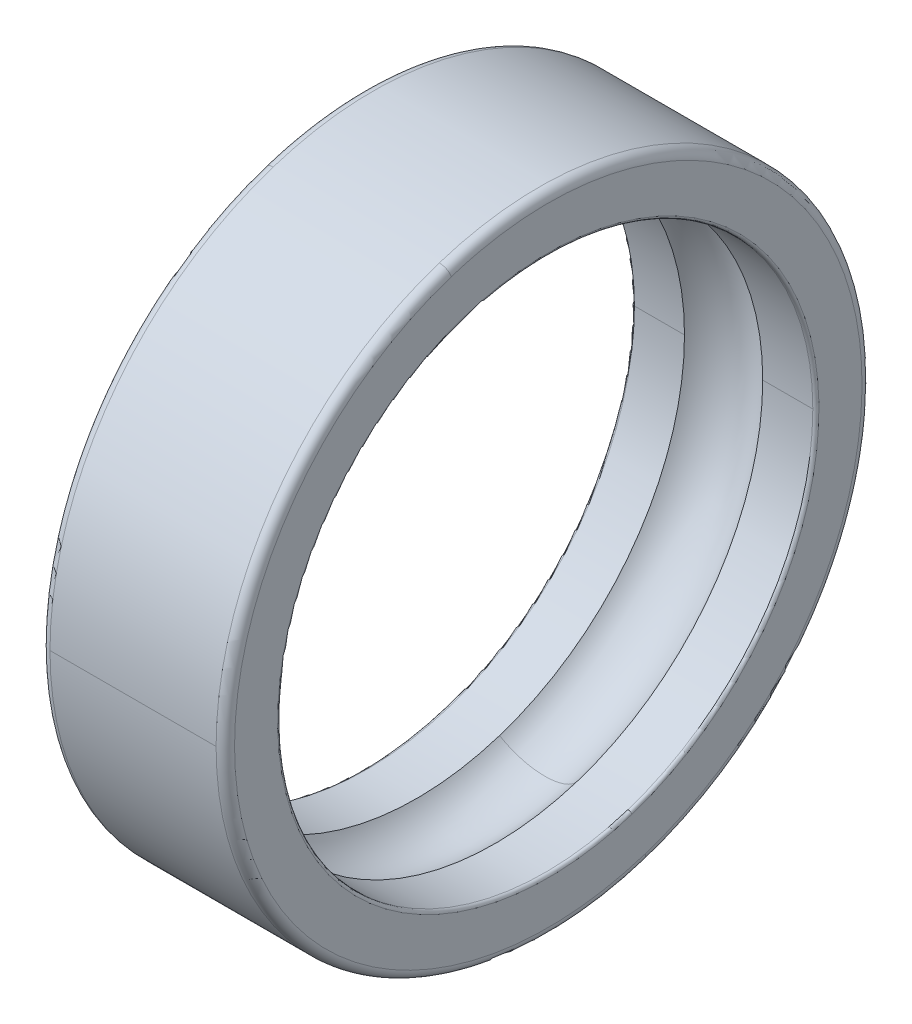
ISO-10303-21;
HEADER;
FILE_DESCRIPTION(('STEP AP214'),'2;1');
FILE_NAME('part.step','',(''),(''),'','','');
FILE_SCHEMA(('AUTOMOTIVE_DESIGN { 1 0 10303 214 1 1 1 1 }'));
ENDSEC;
DATA;
#1=APPLICATION_CONTEXT('core data for automotive mechanical design processes');
#2=APPLICATION_PROTOCOL_DEFINITION('international standard','automotive_design',2000,#1);
#3=PRODUCT_CONTEXT('',#1,'mechanical');
#4=PRODUCT('Part','Part','',(#3));
#5=PRODUCT_RELATED_PRODUCT_CATEGORY('part','',(#4));
#6=PRODUCT_DEFINITION_FORMATION('','',#4);
#7=PRODUCT_DEFINITION_CONTEXT('part definition',#1,'design');
#8=PRODUCT_DEFINITION('design','',#6,#7);
#9=PRODUCT_DEFINITION_SHAPE('','',#8);
#10=(LENGTH_UNIT() NAMED_UNIT(*) SI_UNIT(.MILLI.,.METRE.));
#11=(NAMED_UNIT(*) PLANE_ANGLE_UNIT() SI_UNIT($,.RADIAN.));
#12=(NAMED_UNIT(*) SI_UNIT($,.STERADIAN.) SOLID_ANGLE_UNIT());
#13=UNCERTAINTY_MEASURE_WITH_UNIT(LENGTH_MEASURE(1.E-05),#10,'distance_accuracy_value','');
#14=(GEOMETRIC_REPRESENTATION_CONTEXT(3) GLOBAL_UNCERTAINTY_ASSIGNED_CONTEXT((#13)) GLOBAL_UNIT_ASSIGNED_CONTEXT((#10,
#11,#12)) REPRESENTATION_CONTEXT('',''));
#15=CARTESIAN_POINT('',(0.,0.,0.));
#16=DIRECTION('',(0.,0.,1.));
#17=DIRECTION('',(1.,0.,0.));
#18=AXIS2_PLACEMENT_3D('',#15,#16,#17);
#19=CARTESIAN_POINT('',(0.599999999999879,0.,0.));
#20=DIRECTION('',(1.,0.,0.));
#21=DIRECTION('',(0.,-0.309016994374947,0.951056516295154));
#22=AXIS2_PLACEMENT_3D('',#19,#20,#21);
#23=TOROIDAL_SURFACE('',#22,20.4,0.599999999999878);
#24=CARTESIAN_POINT('',(0.599999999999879,-19.4015529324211,-6.30394668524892));
#25=DIRECTION('',(0.,0.309016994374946,-0.951056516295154));
#26=DIRECTION('',(2.00950367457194E-13,-0.951056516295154,-0.309016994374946));
#27=AXIS2_PLACEMENT_3D('',#24,#25,#26);
#28=CIRCLE('',#27,0.599999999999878);
#29=CARTESIAN_POINT('',(0.6,-19.9721868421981,-6.48935688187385));
#30=VERTEX_POINT('',#29);
#31=CARTESIAN_POINT('',(0.,-19.4015529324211,-6.30394668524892));
#32=VERTEX_POINT('',#31);
#33=EDGE_CURVE('E11',#30,#32,#28,.T.);
#34=ORIENTED_EDGE('',*,*,#33,.T.);
#35=CARTESIAN_POINT('',(0.,-19.4015529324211,-6.30394668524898));
#36=CARTESIAN_POINT('',(0.,-19.2984114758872,-6.62140636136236));
#37=CARTESIAN_POINT('',(0.,-19.1874654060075,-6.93632953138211));
#38=CARTESIAN_POINT('',(0.,-18.9502604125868,-7.56035524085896));
#39=CARTESIAN_POINT('',(0.,-18.8240014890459,-7.86945778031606));
#40=CARTESIAN_POINT('',(0.,-18.5564671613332,-8.48109461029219));
#41=CARTESIAN_POINT('',(0.,-18.4151917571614,-8.78362890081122));
#42=CARTESIAN_POINT('',(0.,-18.1179669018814,-9.38140119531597));
#43=CARTESIAN_POINT('',(0.,-17.9620174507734,-9.67663919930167));
#44=CARTESIAN_POINT('',(0.,-17.6358196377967,-10.2591074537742));
#45=CARTESIAN_POINT('',(0.,-17.4655712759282,-10.546337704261));
#46=CARTESIAN_POINT('',(0.,-17.1111859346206,-11.1120985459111));
#47=CARTESIAN_POINT('',(0.,-16.9270489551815,-11.3906291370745));
#48=CARTESIAN_POINT('',(0.,-16.5453299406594,-11.9383196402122));
#49=CARTESIAN_POINT('',(0.,-16.3477479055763,-12.2074795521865));
#50=CARTESIAN_POINT('',(0.,-15.9396147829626,-12.7357802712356));
#51=CARTESIAN_POINT('',(0.,-15.7290636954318,-12.9949210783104));
#52=CARTESIAN_POINT('',(0.,-15.2954997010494,-13.5025592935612));
#53=CARTESIAN_POINT('',(0.,-15.0724867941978,-13.7510567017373));
#54=CARTESIAN_POINT('',(0.,-14.6145364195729,-14.2368094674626));
#55=CARTESIAN_POINT('',(0.,-14.3795989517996,-14.4740648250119));
#56=CARTESIAN_POINT('',(0.,-13.8983654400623,-14.9367619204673));
#57=CARTESIAN_POINT('',(0.,-13.6520693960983,-15.1622036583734));
#58=CARTESIAN_POINT('',(0.,-13.1487120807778,-15.6007304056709));
#59=CARTESIAN_POINT('',(0.,-12.8916508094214,-15.8138154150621));
#60=CARTESIAN_POINT('',(0.,-12.3673823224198,-16.2271153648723));
#61=CARTESIAN_POINT('',(0.,-12.1001751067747,-16.4273303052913));
#62=CARTESIAN_POINT('',(0.,-11.556258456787,-16.8144077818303));
#63=CARTESIAN_POINT('',(0.,-11.2795490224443,-17.0012703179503));
#64=CARTESIAN_POINT('',(0.,-10.7172945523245,-17.3611928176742));
#65=CARTESIAN_POINT('',(0.,-10.4317495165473,-17.5342527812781));
#66=CARTESIAN_POINT('',(0.,-9.85251174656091,-17.8661532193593));
#67=CARTESIAN_POINT('',(0.,-9.5588190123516,-18.0249936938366));
#68=CARTESIAN_POINT('',(0.,-8.96399337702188,-18.3280724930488));
#69=CARTESIAN_POINT('',(0.,-8.66286047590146,-18.4723108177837));
#70=CARTESIAN_POINT('',(0.,-8.05387996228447,-18.745837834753));
#71=CARTESIAN_POINT('',(0.,-7.7460323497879,-18.8751265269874));
#72=CARTESIAN_POINT('',(0.,-7.12436404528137,-19.1184428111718));
#73=CARTESIAN_POINT('',(0.,-6.81054335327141,-19.2324704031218));
#74=CARTESIAN_POINT('',(0.,-6.17768491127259,-19.4449897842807));
#75=CARTESIAN_POINT('',(0.,-5.85864716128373,-19.5434815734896));
#76=CARTESIAN_POINT('',(0.,-5.21612319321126,-19.7246920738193));
#77=CARTESIAN_POINT('',(0.,-4.89263697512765,-19.80741078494));
#78=CARTESIAN_POINT('',(0.,-4.24199537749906,-19.956875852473));
#79=CARTESIAN_POINT('',(0.,-3.91483999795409,-20.0236222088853));
#80=CARTESIAN_POINT('',(0.,-3.25764822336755,-20.1409817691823));
#81=CARTESIAN_POINT('',(0.,-2.92761182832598,-20.1915949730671));
#82=CARTESIAN_POINT('',(0.,-2.26545310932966,-20.276566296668));
#83=CARTESIAN_POINT('',(0.,-1.93333078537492,-20.3109244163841));
#84=CARTESIAN_POINT('',(0.,-1.26780032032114,-20.3633027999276));
#85=CARTESIAN_POINT('',(0.,-0.934392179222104,-20.381323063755));
#86=CARTESIAN_POINT('',(0.,-0.267093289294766,-20.4009823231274));
#87=CARTESIAN_POINT('',(0.,0.0667974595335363,-20.4026213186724));
#88=CARTESIAN_POINT('',(0.,0.734257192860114,-20.3895140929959));
#89=CARTESIAN_POINT('',(0.,1.06782617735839,-20.3747678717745));
#90=CARTESIAN_POINT('',(0.,1.73383878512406,-20.3289257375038));
#91=CARTESIAN_POINT('',(0.,2.06628240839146,-20.2978298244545));
#92=CARTESIAN_POINT('',(0.,2.72924340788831,-20.2193632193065));
#93=CARTESIAN_POINT('',(0.,3.05976078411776,-20.1719925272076));
#94=CARTESIAN_POINT('',(0.,3.71807304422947,-20.0610904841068));
#95=CARTESIAN_POINT('',(0.,4.04586792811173,-19.9975591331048));
#96=CARTESIAN_POINT('',(0.,4.69794551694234,-19.8544888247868));
#97=CARTESIAN_POINT('',(0.,5.0222282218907,-19.7749498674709));
#98=CARTESIAN_POINT('',(0.,5.66650022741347,-19.6000559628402));
#99=CARTESIAN_POINT('',(0.,5.98648952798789,-19.5047010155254));
#100=CARTESIAN_POINT('',(0.,6.62140384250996,-19.2984048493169));
#101=CARTESIAN_POINT('',(0.,6.9363288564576,-19.1874636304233));
#102=CARTESIAN_POINT('',(0.,7.56035591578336,-18.950262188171));
#103=CARTESIAN_POINT('',(0.,7.86945796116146,-18.8240019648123));
#104=CARTESIAN_POINT('',(0.,8.48109442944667,-18.5564666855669));
#105=CARTESIAN_POINT('',(0.,8.78362885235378,-18.4151916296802));
#106=CARTESIAN_POINT('',(0.,9.38140124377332,-18.1179670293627));
#107=CARTESIAN_POINT('',(0.,9.67663921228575,-17.9620174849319));
#108=CARTESIAN_POINT('',(0.,10.25910744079,-17.6358196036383));
#109=CARTESIAN_POINT('',(0.,10.5463377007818,-17.4655712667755));
#110=CARTESIAN_POINT('',(0.,11.1120985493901,-17.1111859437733));
#111=CARTESIAN_POINT('',(0.,11.3906291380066,-16.927048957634));
#112=CARTESIAN_POINT('',(0.,11.9383196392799,-16.545329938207));
#113=CARTESIAN_POINT('',(0.,12.2074795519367,-16.3477479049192));
#114=CARTESIAN_POINT('',(0.,12.7357802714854,-15.9396147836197));
#115=CARTESIAN_POINT('',(0.,12.9949210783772,-15.7290636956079));
#116=CARTESIAN_POINT('',(0.,13.5025592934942,-15.2954997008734));
#117=CARTESIAN_POINT('',(0.,13.7510567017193,-15.0724867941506));
#118=CARTESIAN_POINT('',(0.,14.2368094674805,-14.6145364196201));
#119=CARTESIAN_POINT('',(0.,14.4740648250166,-14.3795989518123));
#120=CARTESIAN_POINT('',(0.,14.9367619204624,-13.8983654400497));
#121=CARTESIAN_POINT('',(0.,15.1622036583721,-13.6520693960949));
#122=CARTESIAN_POINT('',(0.,15.6007304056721,-13.1487120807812));
#123=CARTESIAN_POINT('',(0.,15.8138154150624,-12.8916508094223));
#124=CARTESIAN_POINT('',(0.,16.227115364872,-12.367382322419));
#125=CARTESIAN_POINT('',(0.,16.4273303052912,-12.1001751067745));
#126=CARTESIAN_POINT('',(0.,16.8144077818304,-11.5562584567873));
#127=CARTESIAN_POINT('',(0.,17.0012703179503,-11.2795490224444));
#128=CARTESIAN_POINT('',(0.,17.3611928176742,-10.7172945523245));
#129=CARTESIAN_POINT('',(0.,17.5342527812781,-10.4317495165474));
#130=CARTESIAN_POINT('',(0.,17.8661532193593,-9.85251174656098));
#131=CARTESIAN_POINT('',(0.,18.0249936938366,-9.55881901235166));
#132=CARTESIAN_POINT('',(0.,18.3280724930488,-8.96399337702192));
#133=CARTESIAN_POINT('',(0.,18.4723108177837,-8.66286047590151));
#134=CARTESIAN_POINT('',(0.,18.745837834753,-8.05387996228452));
#135=CARTESIAN_POINT('',(0.,18.8751265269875,-7.74603234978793));
#136=CARTESIAN_POINT('',(0.,19.1184428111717,-7.12436404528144));
#137=CARTESIAN_POINT('',(0.,19.2324704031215,-6.81054335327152));
#138=CARTESIAN_POINT('',(0.,19.4449897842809,-6.17768491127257));
#139=CARTESIAN_POINT('',(0.,19.5434815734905,-5.85864716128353));
#140=CARTESIAN_POINT('',(0.,19.7246920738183,-5.21612319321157));
#141=CARTESIAN_POINT('',(0.,19.8074107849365,-4.89263697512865));
#142=CARTESIAN_POINT('',(0.,19.9568758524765,-4.24199537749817));
#143=CARTESIAN_POINT('',(0.,20.0236222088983,-3.9148399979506));
#144=CARTESIAN_POINT('',(0.,20.1409817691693,-3.25764822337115));
#145=CARTESIAN_POINT('',(0.,20.1915949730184,-2.92761182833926));
#146=CARTESIAN_POINT('',(0.,20.2765662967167,-2.2654531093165));
#147=CARTESIAN_POINT('',(0.,20.3109244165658,-1.93333078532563));
#148=CARTESIAN_POINT('',(0.,20.3633027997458,-1.26780032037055));
#149=CARTESIAN_POINT('',(0.,20.3813230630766,-0.934392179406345));
#150=CARTESIAN_POINT('',(0.,20.4009823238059,-0.267093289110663));
#151=CARTESIAN_POINT('',(0.,20.4026213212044,0.0667974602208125));
#152=CARTESIAN_POINT('',(0.,20.3895140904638,0.734257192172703));
#153=CARTESIAN_POINT('',(0.,20.3747678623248,1.06782617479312));
#154=CARTESIAN_POINT('',(0.,20.3289257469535,1.73383878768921));
#155=CARTESIAN_POINT('',(0.,20.2978298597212,2.06628241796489));
#156=CARTESIAN_POINT('',(0.,20.2193631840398,2.72924339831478));
#157=CARTESIAN_POINT('',(0.,20.1719923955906,3.059760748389));
#158=CARTESIAN_POINT('',(0.,20.0610906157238,3.71807307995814));
#159=CARTESIAN_POINT('',(0.,19.9975596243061,4.04586806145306));
#160=CARTESIAN_POINT('',(0.,19.8544883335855,4.6979453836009));
#161=CARTESIAN_POINT('',(0.,19.7749480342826,5.02222772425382));
#162=CARTESIAN_POINT('',(0.,19.6000577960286,5.66650072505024));
#163=CARTESIAN_POINT('',(0.,19.5047078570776,5.98649138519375));
#164=CARTESIAN_POINT('',(0.,19.4015529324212,6.30394668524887));
#165=B_SPLINE_CURVE_WITH_KNOTS('',3,(#35,#36,#37,#38,#39,#40,#41,#42,#43,#44,#45,#46,#47,#48,
#49,#50,#51,#52,#53,#54,#55,#56,#57,#58,#59,#60,#61,#62,#63,#64,#65,#66,#67,#68,#69,#70,#71,#72,
#73,#74,#75,#76,#77,#78,#79,#80,#81,#82,#83,#84,#85,#86,#87,#88,#89,#90,#91,#92,#93,#94,#95,#96,
#97,#98,#99,#100,#101,#102,#103,#104,#105,#106,#107,#108,#109,#110,#111,#112,#113,#114,#115,
#116,#117,#118,#119,#120,#121,#122,#123,#124,#125,#126,#127,#128,#129,#130,#131,#132,#133,#134,
#135,#136,#137,#138,#139,#140,#141,#142,#143,#144,#145,#146,#147,#148,#149,#150,#151,#152,#153,
#154,#155,#156,#157,#158,#159,#160,#161,#162,#163,#164),.UNSPECIFIED.,.F.,.F.,(4,2,2,2,2,2,2,2,
2,2,2,2,2,2,2,2,2,2,2,2,2,2,2,2,2,2,2,2,2,2,2,2,2,2,2,2,2,2,2,2,2,2,2,2,2,2,2,2,2,2,2,2,2,2,2,2,
2,2,2,2,2,2,2,2,4),(0.,1.00128212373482,2.00256424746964,3.00384637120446,4.00512849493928,
5.0064106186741,6.00769274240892,7.00897486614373,8.01025698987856,9.01153911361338,
10.0128212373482,11.014103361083,12.0153854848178,13.0166676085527,14.0179497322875,
15.0192318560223,16.0205139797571,17.0217961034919,18.0230782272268,19.0243603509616,
20.0256424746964,21.0269245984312,22.028206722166,23.0294888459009,24.0307709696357,
25.0320530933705,26.0333352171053,27.0346173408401,28.0358994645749,29.0371815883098,
30.0384637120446,31.0397458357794,32.0410279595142,33.042310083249,34.0435922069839,
35.0448743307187,36.0461564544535,37.0474385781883,38.0487207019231,39.050002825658,
40.0512849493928,41.0525670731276,42.0538491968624,43.0551313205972,44.0564134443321,
45.0576955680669,46.0589776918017,47.0602598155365,48.0615419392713,49.0628240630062,
50.064106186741,51.0653883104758,52.0666704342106,53.0679525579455,54.0692346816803,
55.0705168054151,56.0717989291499,57.0730810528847,58.0743631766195,59.0756453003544,
60.0769274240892,61.078209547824,62.0794916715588,63.0807737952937,64.0820559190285),.UNSPECIFIED.);
#166=CARTESIAN_POINT('',(0.,19.4015529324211,6.30394668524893));
#167=VERTEX_POINT('',#166);
#168=EDGE_CURVE('E26',#32,#167,#165,.T.);
#169=ORIENTED_EDGE('',*,*,#168,.T.);
#170=CARTESIAN_POINT('',(0.599999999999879,19.4015529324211,6.30394668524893));
#171=DIRECTION('',(0.,-0.309016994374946,0.951056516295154));
#172=DIRECTION('',(2.02800739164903E-13,0.951056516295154,0.309016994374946));
#173=AXIS2_PLACEMENT_3D('',#170,#171,#172);
#174=CIRCLE('',#173,0.599999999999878);
#175=CARTESIAN_POINT('',(0.600000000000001,19.9721868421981,6.48935688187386));
#176=VERTEX_POINT('',#175);
#177=EDGE_CURVE('E307',#176,#167,#174,.T.);
#178=ORIENTED_EDGE('',*,*,#177,.F.);
#179=CARTESIAN_POINT('',(0.6,0.,0.));
#180=DIRECTION('',(1.,0.,0.));
#181=DIRECTION('',(0.,0.,-1.));
#182=AXIS2_PLACEMENT_3D('',#179,#180,#181);
#183=CIRCLE('',#182,21.);
#184=CARTESIAN_POINT('',(0.6,0.,-21.));
#185=VERTEX_POINT('',#184);
#186=EDGE_CURVE('E308',#185,#176,#183,.T.);
#187=ORIENTED_EDGE('',*,*,#186,.F.);
#188=CARTESIAN_POINT('',(0.6,0.,0.));
#189=DIRECTION('',(1.,0.,0.));
#190=DIRECTION('',(0.,0.,-1.));
#191=AXIS2_PLACEMENT_3D('',#188,#189,#190);
#192=CIRCLE('',#191,21.);
#193=EDGE_CURVE('E313',#30,#185,#192,.T.);
#194=ORIENTED_EDGE('',*,*,#193,.F.);
#195=EDGE_LOOP('',(#34,#169,#178,#187,#194));
#196=FACE_BOUND('',#195,.T.);
#197=ADVANCED_FACE('F17',(#196),#23,.T.);
#198=CARTESIAN_POINT('',(50.,0.,0.));
#199=DIRECTION('',(1.,0.,0.));
#200=DIRECTION('',(0.,1.,0.));
#201=AXIS2_PLACEMENT_3D('',#198,#199,#200);
#202=CYLINDRICAL_SURFACE('',#201,21.);
#203=DIRECTION('',(1.,0.,0.));
#204=VECTOR('',#203,1.);
#205=CARTESIAN_POINT('',(0.600000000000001,0.,21.));
#206=LINE('',#205,#204);
#207=CARTESIAN_POINT('',(0.600000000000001,0.,21.));
#208=VERTEX_POINT('',#207);
#209=CARTESIAN_POINT('',(11.4,0.,21.));
#210=VERTEX_POINT('',#209);
#211=EDGE_CURVE('E332',#208,#210,#206,.T.);
#212=ORIENTED_EDGE('',*,*,#211,.F.);
#213=CARTESIAN_POINT('',(0.6,0.,0.));
#214=DIRECTION('',(1.,0.,0.));
#215=DIRECTION('',(0.,0.,-1.));
#216=AXIS2_PLACEMENT_3D('',#213,#214,#215);
#217=CIRCLE('',#216,21.);
#218=EDGE_CURVE('E337',#208,#30,#217,.T.);
#219=ORIENTED_EDGE('',*,*,#218,.T.);
#220=ORIENTED_EDGE('',*,*,#193,.T.);
#221=DIRECTION('',(1.,0.,0.));
#222=VECTOR('',#221,1.);
#223=CARTESIAN_POINT('',(0.600000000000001,0.,-21.));
#224=LINE('',#223,#222);
#225=CARTESIAN_POINT('',(11.4,0.,-21.));
#226=VERTEX_POINT('',#225);
#227=EDGE_CURVE('E342',#185,#226,#224,.T.);
#228=ORIENTED_EDGE('',*,*,#227,.T.);
#229=CARTESIAN_POINT('',(11.4,0.,0.));
#230=DIRECTION('',(1.,0.,0.));
#231=DIRECTION('',(0.,0.,-1.));
#232=AXIS2_PLACEMENT_3D('',#229,#230,#231);
#233=CIRCLE('',#232,21.);
#234=CARTESIAN_POINT('',(11.4,-19.9721868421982,-6.48935688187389));
#235=VERTEX_POINT('',#234);
#236=EDGE_CURVE('E346',#235,#226,#233,.T.);
#237=ORIENTED_EDGE('',*,*,#236,.F.);
#238=CARTESIAN_POINT('',(11.4,0.,0.));
#239=DIRECTION('',(1.,0.,0.));
#240=DIRECTION('',(0.,0.,-1.));
#241=AXIS2_PLACEMENT_3D('',#238,#239,#240);
#242=CIRCLE('',#241,21.);
#243=EDGE_CURVE('E351',#210,#235,#242,.T.);
#244=ORIENTED_EDGE('',*,*,#243,.F.);
#245=EDGE_LOOP('',(#212,#219,#220,#228,#237,#244));
#246=FACE_BOUND('',#245,.T.);
#247=ADVANCED_FACE('F452',(#246),#202,.T.);
#248=CARTESIAN_POINT('',(11.4000000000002,0.,0.));
#249=DIRECTION('',(1.,0.,0.));
#250=DIRECTION('',(0.,0.309016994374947,-0.951056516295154));
#251=AXIS2_PLACEMENT_3D('',#248,#249,#250);
#252=TOROIDAL_SURFACE('',#251,20.4000000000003,0.599999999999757);
#253=CARTESIAN_POINT('',(11.4000000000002,-19.4015529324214,-6.303946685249));
#254=DIRECTION('',(0.,0.309016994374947,-0.951056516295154));
#255=DIRECTION('',(1.,0.,0.));
#256=AXIS2_PLACEMENT_3D('',#253,#254,#255);
#257=CIRCLE('',#256,0.599999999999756);
#258=CARTESIAN_POINT('',(12.,-19.4015529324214,-6.303946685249));
#259=VERTEX_POINT('',#258);
#260=EDGE_CURVE('E356',#259,#235,#257,.T.);
#261=ORIENTED_EDGE('',*,*,#260,.F.);
#262=CARTESIAN_POINT('',(12.,0.,0.));
#263=DIRECTION('',(1.,0.,0.));
#264=DIRECTION('',(0.,0.,-1.));
#265=AXIS2_PLACEMENT_3D('',#262,#263,#264);
#266=CIRCLE('',#265,20.4);
#267=CARTESIAN_POINT('',(12.,19.4015529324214,6.303946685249));
#268=VERTEX_POINT('',#267);
#269=EDGE_CURVE('E361',#268,#259,#266,.T.);
#270=ORIENTED_EDGE('',*,*,#269,.F.);
#271=CARTESIAN_POINT('',(11.4000000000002,19.4015529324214,6.303946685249));
#272=DIRECTION('',(0.,-0.309016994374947,0.951056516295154));
#273=DIRECTION('',(1.,0.,0.));
#274=AXIS2_PLACEMENT_3D('',#271,#272,#273);
#275=CIRCLE('',#274,0.599999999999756);
#276=CARTESIAN_POINT('',(11.4,19.9721868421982,6.4893568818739));
#277=VERTEX_POINT('',#276);
#278=EDGE_CURVE('E366',#268,#277,#275,.T.);
#279=ORIENTED_EDGE('',*,*,#278,.T.);
#280=CARTESIAN_POINT('',(11.4,0.,0.));
#281=DIRECTION('',(1.,0.,0.));
#282=DIRECTION('',(0.,0.,-1.));
#283=AXIS2_PLACEMENT_3D('',#280,#281,#282);
#284=CIRCLE('',#283,21.);
#285=EDGE_CURVE('E370',#277,#210,#284,.T.);
#286=ORIENTED_EDGE('',*,*,#285,.T.);
#287=ORIENTED_EDGE('',*,*,#243,.T.);
#288=EDGE_LOOP('',(#261,#270,#279,#286,#287));
#289=FACE_BOUND('',#288,.T.);
#290=ADVANCED_FACE('F456',(#289),#252,.T.);
#291=CARTESIAN_POINT('',(50.,0.,0.));
#292=DIRECTION('',(1.,0.,0.));
#293=DIRECTION('',(0.,-1.,0.));
#294=AXIS2_PLACEMENT_3D('',#291,#292,#293);
#295=CYLINDRICAL_SURFACE('',#294,21.);
#296=ORIENTED_EDGE('',*,*,#211,.T.);
#297=ORIENTED_EDGE('',*,*,#285,.F.);
#298=CARTESIAN_POINT('',(11.4,0.,0.));
#299=DIRECTION('',(1.,0.,0.));
#300=DIRECTION('',(0.,0.,-1.));
#301=AXIS2_PLACEMENT_3D('',#298,#299,#300);
#302=CIRCLE('',#301,21.);
#303=EDGE_CURVE('E375',#226,#277,#302,.T.);
#304=ORIENTED_EDGE('',*,*,#303,.F.);
#305=ORIENTED_EDGE('',*,*,#227,.F.);
#306=ORIENTED_EDGE('',*,*,#186,.T.);
#307=CARTESIAN_POINT('',(0.6,0.,0.));
#308=DIRECTION('',(1.,0.,0.));
#309=DIRECTION('',(0.,0.,-1.));
#310=AXIS2_PLACEMENT_3D('',#307,#308,#309);
#311=CIRCLE('',#310,21.);
#312=EDGE_CURVE('E380',#176,#208,#311,.T.);
#313=ORIENTED_EDGE('',*,*,#312,.T.);
#314=EDGE_LOOP('',(#296,#297,#304,#305,#306,#313));
#315=FACE_BOUND('',#314,.T.);
#316=ADVANCED_FACE('F461',(#315),#295,.T.);
#317=CARTESIAN_POINT('',(0.599999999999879,0.,0.));
#318=DIRECTION('',(1.,0.,0.));
#319=DIRECTION('',(0.,0.309016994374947,-0.951056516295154));
#320=AXIS2_PLACEMENT_3D('',#317,#318,#319);
#321=TOROIDAL_SURFACE('',#320,20.4,0.599999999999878);
#322=ORIENTED_EDGE('',*,*,#33,.F.);
#323=ORIENTED_EDGE('',*,*,#218,.F.);
#324=ORIENTED_EDGE('',*,*,#312,.F.);
#325=ORIENTED_EDGE('',*,*,#177,.T.);
#326=CARTESIAN_POINT('',(0.,19.4015529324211,6.30394668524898));
#327=CARTESIAN_POINT('',(0.,19.2984114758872,6.62140636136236));
#328=CARTESIAN_POINT('',(0.,19.1874654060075,6.93632953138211));
#329=CARTESIAN_POINT('',(0.,18.9502604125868,7.56035524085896));
#330=CARTESIAN_POINT('',(0.,18.8240014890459,7.86945778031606));
#331=CARTESIAN_POINT('',(0.,18.5564671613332,8.48109461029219));
#332=CARTESIAN_POINT('',(0.,18.4151917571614,8.78362890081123));
#333=CARTESIAN_POINT('',(0.,18.1179669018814,9.38140119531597));
#334=CARTESIAN_POINT('',(0.,17.9620174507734,9.67663919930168));
#335=CARTESIAN_POINT('',(0.,17.6358196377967,10.2591074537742));
#336=CARTESIAN_POINT('',(0.,17.4655712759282,10.546337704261));
#337=CARTESIAN_POINT('',(0.,17.1111859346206,11.1120985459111));
#338=CARTESIAN_POINT('',(0.,16.9270489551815,11.3906291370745));
#339=CARTESIAN_POINT('',(0.,16.5453299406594,11.9383196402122));
#340=CARTESIAN_POINT('',(0.,16.3477479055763,12.2074795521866));
#341=CARTESIAN_POINT('',(0.,15.9396147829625,12.7357802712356));
#342=CARTESIAN_POINT('',(0.,15.7290636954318,12.9949210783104));
#343=CARTESIAN_POINT('',(0.,15.2954997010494,13.5025592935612));
#344=CARTESIAN_POINT('',(0.,15.0724867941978,13.7510567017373));
#345=CARTESIAN_POINT('',(0.,14.6145364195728,14.2368094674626));
#346=CARTESIAN_POINT('',(0.,14.3795989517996,14.4740648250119));
#347=CARTESIAN_POINT('',(0.,13.8983654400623,14.9367619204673));
#348=CARTESIAN_POINT('',(0.,13.6520693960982,15.1622036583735));
#349=CARTESIAN_POINT('',(0.,13.1487120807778,15.6007304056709));
#350=CARTESIAN_POINT('',(0.,12.8916508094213,15.8138154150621));
#351=CARTESIAN_POINT('',(0.,12.3673823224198,16.2271153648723));
#352=CARTESIAN_POINT('',(0.,12.1001751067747,16.4273303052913));
#353=CARTESIAN_POINT('',(0.,11.556258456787,16.8144077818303));
#354=CARTESIAN_POINT('',(0.,11.2795490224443,17.0012703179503));
#355=CARTESIAN_POINT('',(0.,10.7172945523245,17.3611928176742));
#356=CARTESIAN_POINT('',(0.,10.4317495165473,17.5342527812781));
#357=CARTESIAN_POINT('',(0.,9.85251174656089,17.8661532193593));
#358=CARTESIAN_POINT('',(0.,9.55881901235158,18.0249936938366));
#359=CARTESIAN_POINT('',(0.,8.96399337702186,18.3280724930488));
#360=CARTESIAN_POINT('',(0.,8.66286047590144,18.4723108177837));
#361=CARTESIAN_POINT('',(0.,8.05387996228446,18.745837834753));
#362=CARTESIAN_POINT('',(0.,7.74603234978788,18.8751265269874));
#363=CARTESIAN_POINT('',(0.,7.12436404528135,19.1184428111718));
#364=CARTESIAN_POINT('',(0.,6.81054335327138,19.2324704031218));
#365=CARTESIAN_POINT('',(0.,6.17768491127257,19.4449897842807));
#366=CARTESIAN_POINT('',(0.,5.85864716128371,19.5434815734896));
#367=CARTESIAN_POINT('',(0.,5.21612319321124,19.7246920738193));
#368=CARTESIAN_POINT('',(0.,4.89263697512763,19.80741078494));
#369=CARTESIAN_POINT('',(0.,4.24199537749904,19.956875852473));
#370=CARTESIAN_POINT('',(0.,3.91483999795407,20.0236222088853));
#371=CARTESIAN_POINT('',(0.,3.25764822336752,20.1409817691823));
#372=CARTESIAN_POINT('',(0.,2.92761182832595,20.1915949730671));
#373=CARTESIAN_POINT('',(0.,2.26545310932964,20.276566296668));
#374=CARTESIAN_POINT('',(0.,1.93333078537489,20.3109244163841));
#375=CARTESIAN_POINT('',(0.,1.26780032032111,20.3633027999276));
#376=CARTESIAN_POINT('',(0.,0.934392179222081,20.381323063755));
#377=CARTESIAN_POINT('',(0.,0.267093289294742,20.4009823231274));
#378=CARTESIAN_POINT('',(0.,-0.0667974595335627,20.4026213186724));
#379=CARTESIAN_POINT('',(0.,-0.734257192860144,20.3895140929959));
#380=CARTESIAN_POINT('',(0.,-1.06782617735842,20.3747678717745));
#381=CARTESIAN_POINT('',(0.,-1.7338387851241,20.3289257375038));
#382=CARTESIAN_POINT('',(0.,-2.0662824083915,20.2978298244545));
#383=CARTESIAN_POINT('',(0.,-2.72924340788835,20.2193632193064));
#384=CARTESIAN_POINT('',(0.,-3.0597607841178,20.1719925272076));
#385=CARTESIAN_POINT('',(0.,-3.71807304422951,20.0610904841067));
#386=CARTESIAN_POINT('',(0.,-4.04586792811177,19.9975591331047));
#387=CARTESIAN_POINT('',(0.,-4.69794551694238,19.8544888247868));
#388=CARTESIAN_POINT('',(0.,-5.02222822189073,19.7749498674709));
#389=CARTESIAN_POINT('',(0.,-5.66650022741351,19.6000559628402));
#390=CARTESIAN_POINT('',(0.,-5.98648952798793,19.5047010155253));
#391=CARTESIAN_POINT('',(0.,-6.62140384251,19.2984048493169));
#392=CARTESIAN_POINT('',(0.,-6.93632885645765,19.1874636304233));
#393=CARTESIAN_POINT('',(0.,-7.5603559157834,18.950262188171));
#394=CARTESIAN_POINT('',(0.,-7.8694579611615,18.8240019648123));
#395=CARTESIAN_POINT('',(0.,-8.4810944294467,18.5564666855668));
#396=CARTESIAN_POINT('',(0.,-8.78362885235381,18.4151916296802));
#397=CARTESIAN_POINT('',(0.,-9.38140124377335,18.1179670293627));
#398=CARTESIAN_POINT('',(0.,-9.67663921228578,17.9620174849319));
#399=CARTESIAN_POINT('',(0.,-10.25910744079,17.6358196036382));
#400=CARTESIAN_POINT('',(0.,-10.5463377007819,17.4655712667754));
#401=CARTESIAN_POINT('',(0.,-11.1120985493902,17.1111859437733));
#402=CARTESIAN_POINT('',(0.,-11.3906291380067,16.927048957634));
#403=CARTESIAN_POINT('',(0.,-11.93831963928,16.5453299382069));
#404=CARTESIAN_POINT('',(0.,-12.2074795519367,16.3477479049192));
#405=CARTESIAN_POINT('',(0.,-12.7357802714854,15.9396147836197));
#406=CARTESIAN_POINT('',(0.,-12.9949210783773,15.7290636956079));
#407=CARTESIAN_POINT('',(0.,-13.5025592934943,15.2954997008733));
#408=CARTESIAN_POINT('',(0.,-13.7510567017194,15.0724867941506));
#409=CARTESIAN_POINT('',(0.,-14.2368094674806,14.61453641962));
#410=CARTESIAN_POINT('',(0.,-14.4740648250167,14.3795989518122));
#411=CARTESIAN_POINT('',(0.,-14.9367619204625,13.8983654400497));
#412=CARTESIAN_POINT('',(0.,-15.1622036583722,13.6520693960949));
#413=CARTESIAN_POINT('',(0.,-15.6007304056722,13.1487120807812));
#414=CARTESIAN_POINT('',(0.,-15.8138154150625,12.8916508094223));
#415=CARTESIAN_POINT('',(0.,-16.227115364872,12.3673823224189));
#416=CARTESIAN_POINT('',(0.,-16.4273303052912,12.1001751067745));
#417=CARTESIAN_POINT('',(0.,-16.8144077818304,11.5562584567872));
#418=CARTESIAN_POINT('',(0.,-17.0012703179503,11.2795490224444));
#419=CARTESIAN_POINT('',(0.,-17.3611928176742,10.7172945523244));
#420=CARTESIAN_POINT('',(0.,-17.5342527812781,10.4317495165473));
#421=CARTESIAN_POINT('',(0.,-17.8661532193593,9.85251174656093));
#422=CARTESIAN_POINT('',(0.,-18.0249936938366,9.55881901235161));
#423=CARTESIAN_POINT('',(0.,-18.3280724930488,8.96399337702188));
#424=CARTESIAN_POINT('',(0.,-18.4723108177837,8.66286047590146));
#425=CARTESIAN_POINT('',(0.,-18.745837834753,8.05387996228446));
#426=CARTESIAN_POINT('',(0.,-18.8751265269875,7.74603234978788));
#427=CARTESIAN_POINT('',(0.,-19.1184428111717,7.12436404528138));
#428=CARTESIAN_POINT('',(0.,-19.2324704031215,6.81054335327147));
#429=CARTESIAN_POINT('',(0.,-19.4449897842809,6.17768491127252));
#430=CARTESIAN_POINT('',(0.,-19.5434815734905,5.85864716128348));
#431=CARTESIAN_POINT('',(0.,-19.7246920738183,5.21612319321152));
#432=CARTESIAN_POINT('',(0.,-19.8074107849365,4.8926369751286));
#433=CARTESIAN_POINT('',(0.,-19.9568758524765,4.24199537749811));
#434=CARTESIAN_POINT('',(0.,-20.0236222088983,3.91483999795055));
#435=CARTESIAN_POINT('',(0.,-20.1409817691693,3.25764822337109));
#436=CARTESIAN_POINT('',(0.,-20.1915949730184,2.92761182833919));
#437=CARTESIAN_POINT('',(0.,-20.2765662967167,2.26545310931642));
#438=CARTESIAN_POINT('',(0.,-20.3109244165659,1.93333078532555));
#439=CARTESIAN_POINT('',(0.,-20.3633027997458,1.26780032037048));
#440=CARTESIAN_POINT('',(0.,-20.3813230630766,0.934392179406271));
#441=CARTESIAN_POINT('',(0.,-20.4009823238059,0.267093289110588));
#442=CARTESIAN_POINT('',(0.,-20.4026213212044,-0.0667974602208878));
#443=CARTESIAN_POINT('',(0.,-20.3895140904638,-0.734257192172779));
#444=CARTESIAN_POINT('',(0.,-20.3747678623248,-1.06782617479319));
#445=CARTESIAN_POINT('',(0.,-20.3289257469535,-1.73383878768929));
#446=CARTESIAN_POINT('',(0.,-20.2978298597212,-2.06628241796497));
#447=CARTESIAN_POINT('',(0.,-20.2193631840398,-2.72924339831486));
#448=CARTESIAN_POINT('',(0.,-20.1719923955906,-3.05976074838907));
#449=CARTESIAN_POINT('',(0.,-20.0610906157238,-3.71807307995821));
#450=CARTESIAN_POINT('',(0.,-19.9975596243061,-4.04586806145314));
#451=CARTESIAN_POINT('',(0.,-19.8544883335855,-4.69794538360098));
#452=CARTESIAN_POINT('',(0.,-19.7749480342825,-5.02222772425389));
#453=CARTESIAN_POINT('',(0.,-19.6000577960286,-5.66650072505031));
#454=CARTESIAN_POINT('',(0.,-19.5047078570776,-5.98649138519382));
#455=CARTESIAN_POINT('',(0.,-19.4015529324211,-6.30394668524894));
#456=B_SPLINE_CURVE_WITH_KNOTS('',3,(#326,#327,#328,#329,#330,#331,#332,#333,#334,#335,#336,
#337,#338,#339,#340,#341,#342,#343,#344,#345,#346,#347,#348,#349,#350,#351,#352,#353,#354,#355,
#356,#357,#358,#359,#360,#361,#362,#363,#364,#365,#366,#367,#368,#369,#370,#371,#372,#373,#374,
#375,#376,#377,#378,#379,#380,#381,#382,#383,#384,#385,#386,#387,#388,#389,#390,#391,#392,#393,
#394,#395,#396,#397,#398,#399,#400,#401,#402,#403,#404,#405,#406,#407,#408,#409,#410,#411,#412,
#413,#414,#415,#416,#417,#418,#419,#420,#421,#422,#423,#424,#425,#426,#427,#428,#429,#430,#431,
#432,#433,#434,#435,#436,#437,#438,#439,#440,#441,#442,#443,#444,#445,#446,#447,#448,#449,#450,
#451,#452,#453,#454,#455),.UNSPECIFIED.,.F.,.F.,(4,2,2,2,2,2,2,2,2,2,2,2,2,2,2,2,2,2,2,2,2,2,2,
2,2,2,2,2,2,2,2,2,2,2,2,2,2,2,2,2,2,2,2,2,2,2,2,2,2,2,2,2,2,2,2,2,2,2,2,2,2,2,2,2,4),(0.,
1.00128212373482,2.00256424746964,3.00384637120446,4.00512849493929,5.0064106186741,
6.00769274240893,7.00897486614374,8.01025698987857,9.01153911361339,10.0128212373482,
11.014103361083,12.0153854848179,13.0166676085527,14.0179497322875,15.0192318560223,
16.0205139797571,17.021796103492,18.0230782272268,19.0243603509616,20.0256424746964,
21.0269245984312,22.0282067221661,23.0294888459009,24.0307709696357,25.0320530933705,
26.0333352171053,27.0346173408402,28.035899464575,29.0371815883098,30.0384637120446,
31.0397458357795,32.0410279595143,33.0423100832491,34.0435922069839,35.0448743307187,
36.0461564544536,37.0474385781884,38.0487207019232,39.050002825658,40.0512849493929,
41.0525670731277,42.0538491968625,43.0551313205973,44.0564134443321,45.057695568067,
46.0589776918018,47.0602598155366,48.0615419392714,49.0628240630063,50.0641061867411,
51.0653883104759,52.0666704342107,53.0679525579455,54.0692346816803,55.0705168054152,
56.07179892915,57.0730810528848,58.0743631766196,59.0756453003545,60.0769274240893,
61.0782095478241,62.0794916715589,63.0807737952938,64.0820559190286),.UNSPECIFIED.);
#457=EDGE_CURVE('E298',#167,#32,#456,.T.);
#458=ORIENTED_EDGE('',*,*,#457,.T.);
#459=EDGE_LOOP('',(#322,#323,#324,#325,#458));
#460=FACE_BOUND('',#459,.T.);
#461=ADVANCED_FACE('F273',(#460),#321,.T.);
#462=CARTESIAN_POINT('',(0.,20.4,0.));
#463=DIRECTION('',(-1.,0.,0.));
#464=DIRECTION('',(0.,0.,1.));
#465=AXIS2_PLACEMENT_3D('',#462,#463,#464);
#466=PLANE('',#465);
#467=CARTESIAN_POINT('',(0.,0.,0.));
#468=DIRECTION('',(1.,0.,0.));
#469=DIRECTION('',(0.,0.,-1.));
#470=AXIS2_PLACEMENT_3D('',#467,#468,#469);
#471=CIRCLE('',#470,17.6);
#472=CARTESIAN_POINT('',(0.,16.7385946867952,5.43869910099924));
#473=VERTEX_POINT('',#472);
#474=CARTESIAN_POINT('',(0.,-16.7385946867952,-5.43869910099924));
#475=VERTEX_POINT('',#474);
#476=EDGE_CURVE('E396',#473,#475,#471,.T.);
#477=ORIENTED_EDGE('',*,*,#476,.T.);
#478=CARTESIAN_POINT('',(0.,-16.7385946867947,-5.43869910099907));
#479=CARTESIAN_POINT('',(0.,-15.8842511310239,-8.06796680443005));
#480=CARTESIAN_POINT('',(0.,-14.513864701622,-10.5296439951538));
#481=CARTESIAN_POINT('',(0.,-12.6704142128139,-12.6879308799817));
#482=CARTESIAN_POINT('',(0.,-8.2366232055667,-16.1652770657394));
#483=CARTESIAN_POINT('',(0.,-2.81727055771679,-17.7083742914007));
#484=CARTESIAN_POINT('',(0.,0.0123868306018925,-17.931077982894));
#485=CARTESIAN_POINT('',(0.,5.60640376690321,-17.2547365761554));
#486=CARTESIAN_POINT('',(0.,10.529602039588,-14.5138276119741));
#487=CARTESIAN_POINT('',(0.,12.6879410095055,-12.6704256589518));
#488=CARTESIAN_POINT('',(0.,16.1652796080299,-8.23661821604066));
#489=CARTESIAN_POINT('',(0.,17.7083590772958,-2.81726909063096));
#490=CARTESIAN_POINT('',(0.,17.9311326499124,0.0123746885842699));
#491=CARTESIAN_POINT('',(0.,17.592861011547,2.80940630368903));
#492=CARTESIAN_POINT('',(0.,16.7385946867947,5.43869910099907));
#493=B_SPLINE_CURVE_WITH_KNOTS('',5,(#478,#479,#480,#481,#482,#483,#484,#485,#486,#487,#488,
#489,#490,#491,#492),.UNSPECIFIED.,.F.,.F.,(6,3,3,3,6),(0.,0.785398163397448,1.5707963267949,
2.35619449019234,3.14159265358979),.UNSPECIFIED.);
#494=EDGE_CURVE('E397',#475,#473,#493,.T.);
#495=ORIENTED_EDGE('',*,*,#494,.T.);
#496=EDGE_LOOP('',(#477,#495));
#497=FACE_BOUND('',#496,.T.);
#498=ORIENTED_EDGE('',*,*,#168,.F.);
#499=ORIENTED_EDGE('',*,*,#457,.F.);
#500=EDGE_LOOP('',(#498,#499));
#501=FACE_BOUND('',#500,.T.);
#502=ADVANCED_FACE('F267',(#497,#501),#466,.T.);
#503=CARTESIAN_POINT('',(0.200000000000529,0.,0.));
#504=DIRECTION('',(1.,0.,0.));
#505=DIRECTION('',(0.,-0.309016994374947,0.951056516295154));
#506=AXIS2_PLACEMENT_3D('',#503,#504,#505);
#507=TOROIDAL_SURFACE('',#506,17.6000000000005,0.200000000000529);
#508=CARTESIAN_POINT('',(0.200000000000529,-16.7385946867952,-5.43869910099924));
#509=DIRECTION('',(0.,0.309016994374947,-0.951056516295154));
#510=DIRECTION('',(-1.,0.,0.));
#511=AXIS2_PLACEMENT_3D('',#508,#509,#510);
#512=CIRCLE('',#511,0.200000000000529);
#513=CARTESIAN_POINT('',(0.2,-16.5483833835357,-5.37689570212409));
#514=VERTEX_POINT('',#513);
#515=EDGE_CURVE('E401',#475,#514,#512,.T.);
#516=ORIENTED_EDGE('',*,*,#515,.T.);
#517=CARTESIAN_POINT('',(0.2,0.,0.));
#518=DIRECTION('',(1.,0.,0.));
#519=DIRECTION('',(0.,0.,-1.));
#520=AXIS2_PLACEMENT_3D('',#517,#518,#519);
#521=CIRCLE('',#520,17.4);
#522=CARTESIAN_POINT('',(0.2,0.,-17.4));
#523=VERTEX_POINT('',#522);
#524=EDGE_CURVE('E409',#514,#523,#521,.T.);
#525=ORIENTED_EDGE('',*,*,#524,.T.);
#526=CARTESIAN_POINT('',(0.2,0.,0.));
#527=DIRECTION('',(1.,0.,0.));
#528=DIRECTION('',(0.,0.,-1.));
#529=AXIS2_PLACEMENT_3D('',#526,#527,#528);
#530=CIRCLE('',#529,17.4);
#531=CARTESIAN_POINT('',(0.2,16.5483833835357,5.37689570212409));
#532=VERTEX_POINT('',#531);
#533=EDGE_CURVE('E404',#523,#532,#530,.T.);
#534=ORIENTED_EDGE('',*,*,#533,.T.);
#535=CARTESIAN_POINT('',(0.200000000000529,16.7385946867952,5.43869910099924));
#536=DIRECTION('',(0.,-0.309016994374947,0.951056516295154));
#537=DIRECTION('',(-1.,0.,0.));
#538=AXIS2_PLACEMENT_3D('',#535,#536,#537);
#539=CIRCLE('',#538,0.200000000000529);
#540=EDGE_CURVE('E247',#473,#532,#539,.T.);
#541=ORIENTED_EDGE('',*,*,#540,.F.);
#542=ORIENTED_EDGE('',*,*,#494,.F.);
#543=EDGE_LOOP('',(#516,#525,#534,#541,#542));
#544=FACE_BOUND('',#543,.T.);
#545=ADVANCED_FACE('F256',(#544),#507,.T.);
#546=CARTESIAN_POINT('',(0.200000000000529,0.,0.));
#547=DIRECTION('',(1.,0.,0.));
#548=DIRECTION('',(0.,0.309016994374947,-0.951056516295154));
#549=AXIS2_PLACEMENT_3D('',#546,#547,#548);
#550=TOROIDAL_SURFACE('',#549,17.6000000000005,0.200000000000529);
#551=ORIENTED_EDGE('',*,*,#515,.F.);
#552=ORIENTED_EDGE('',*,*,#476,.F.);
#553=ORIENTED_EDGE('',*,*,#540,.T.);
#554=CARTESIAN_POINT('',(0.2,0.,0.));
#555=DIRECTION('',(1.,0.,0.));
#556=DIRECTION('',(0.,0.,-1.));
#557=AXIS2_PLACEMENT_3D('',#554,#555,#556);
#558=CIRCLE('',#557,17.4);
#559=CARTESIAN_POINT('',(0.200000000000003,0.,17.4));
#560=VERTEX_POINT('',#559);
#561=EDGE_CURVE('E243',#532,#560,#558,.T.);
#562=ORIENTED_EDGE('',*,*,#561,.T.);
#563=CARTESIAN_POINT('',(0.2,0.,0.));
#564=DIRECTION('',(1.,0.,0.));
#565=DIRECTION('',(0.,0.,-1.));
#566=AXIS2_PLACEMENT_3D('',#563,#564,#565);
#567=CIRCLE('',#566,17.4);
#568=EDGE_CURVE('E238',#560,#514,#567,.T.);
#569=ORIENTED_EDGE('',*,*,#568,.T.);
#570=EDGE_LOOP('',(#551,#552,#553,#562,#569));
#571=FACE_BOUND('',#570,.T.);
#572=ADVANCED_FACE('F266',(#571),#550,.T.);
#573=CARTESIAN_POINT('',(50.,0.,0.));
#574=DIRECTION('',(1.,0.,0.));
#575=DIRECTION('',(0.,1.,0.));
#576=AXIS2_PLACEMENT_3D('',#573,#574,#575);
#577=CYLINDRICAL_SURFACE('',#576,17.4);
#578=DIRECTION('',(1.,0.,0.));
#579=VECTOR('',#578,1.);
#580=CARTESIAN_POINT('',(0.200000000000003,0.,17.4));
#581=LINE('',#580,#579);
#582=CARTESIAN_POINT('',(3.4562576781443,0.,17.4));
#583=VERTEX_POINT('',#582);
#584=EDGE_CURVE('E234',#560,#583,#581,.T.);
#585=ORIENTED_EDGE('',*,*,#584,.T.);
#586=CARTESIAN_POINT('',(3.4562576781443,0.,0.));
#587=DIRECTION('',(1.,0.,0.));
#588=DIRECTION('',(0.,0.,-1.));
#589=AXIS2_PLACEMENT_3D('',#586,#587,#588);
#590=CIRCLE('',#589,17.4);
#591=CARTESIAN_POINT('',(3.45625767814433,-16.5483833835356,-5.37689570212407));
#592=VERTEX_POINT('',#591);
#593=EDGE_CURVE('E230',#583,#592,#590,.T.);
#594=ORIENTED_EDGE('',*,*,#593,.T.);
#595=CARTESIAN_POINT('',(3.4562576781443,0.,0.));
#596=DIRECTION('',(1.,0.,0.));
#597=DIRECTION('',(0.,0.,-1.));
#598=AXIS2_PLACEMENT_3D('',#595,#596,#597);
#599=CIRCLE('',#598,17.4);
#600=CARTESIAN_POINT('',(3.4562576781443,0.,-17.4));
#601=VERTEX_POINT('',#600);
#602=EDGE_CURVE('E226',#592,#601,#599,.T.);
#603=ORIENTED_EDGE('',*,*,#602,.T.);
#604=DIRECTION('',(1.,0.,0.));
#605=VECTOR('',#604,1.);
#606=CARTESIAN_POINT('',(0.200000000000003,0.,-17.4));
#607=LINE('',#606,#605);
#608=EDGE_CURVE('E221',#523,#601,#607,.T.);
#609=ORIENTED_EDGE('',*,*,#608,.F.);
#610=ORIENTED_EDGE('',*,*,#524,.F.);
#611=ORIENTED_EDGE('',*,*,#568,.F.);
#612=EDGE_LOOP('',(#585,#594,#603,#609,#610,#611));
#613=FACE_BOUND('',#612,.T.);
#614=ADVANCED_FACE('F420',(#613),#577,.F.);
#615=CARTESIAN_POINT('',(50.,0.,0.));
#616=DIRECTION('',(1.,0.,0.));
#617=DIRECTION('',(0.,-1.,0.));
#618=AXIS2_PLACEMENT_3D('',#615,#616,#617);
#619=CYLINDRICAL_SURFACE('',#618,17.4);
#620=ORIENTED_EDGE('',*,*,#584,.F.);
#621=ORIENTED_EDGE('',*,*,#561,.F.);
#622=ORIENTED_EDGE('',*,*,#533,.F.);
#623=ORIENTED_EDGE('',*,*,#608,.T.);
#624=CARTESIAN_POINT('',(3.4562576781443,0.,0.));
#625=DIRECTION('',(1.,0.,0.));
#626=DIRECTION('',(0.,0.,-1.));
#627=AXIS2_PLACEMENT_3D('',#624,#625,#626);
#628=CIRCLE('',#627,17.4);
#629=CARTESIAN_POINT('',(3.45625767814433,16.5483833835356,5.37689570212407));
#630=VERTEX_POINT('',#629);
#631=EDGE_CURVE('E217',#601,#630,#628,.T.);
#632=ORIENTED_EDGE('',*,*,#631,.T.);
#633=CARTESIAN_POINT('',(3.4562576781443,0.,0.));
#634=DIRECTION('',(1.,0.,0.));
#635=DIRECTION('',(0.,0.,-1.));
#636=AXIS2_PLACEMENT_3D('',#633,#634,#635);
#637=CIRCLE('',#636,17.4);
#638=EDGE_CURVE('E212',#630,#583,#637,.T.);
#639=ORIENTED_EDGE('',*,*,#638,.T.);
#640=EDGE_LOOP('',(#620,#621,#622,#623,#632,#639));
#641=FACE_BOUND('',#640,.T.);
#642=ADVANCED_FACE('F425',(#641),#619,.F.);
#643=CARTESIAN_POINT('',(6.,0.,0.));
#644=DIRECTION('',(1.,0.,0.));
#645=DIRECTION('',(0.,0.309016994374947,-0.951056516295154));
#646=AXIS2_PLACEMENT_3D('',#643,#644,#645);
#647=TOROIDAL_SURFACE('',#646,15.5,3.17499999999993);
#648=CARTESIAN_POINT('',(6.,-14.7413760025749,-4.78976341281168));
#649=DIRECTION('',(0.,0.309016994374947,-0.951056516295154));
#650=DIRECTION('',(0.801178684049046,-0.569136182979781,-0.184923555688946));
#651=AXIS2_PLACEMENT_3D('',#648,#649,#650);
#652=CIRCLE('',#651,3.17499999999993);
#653=CARTESIAN_POINT('',(8.54374232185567,-16.5483833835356,-5.37689570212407));
#654=VERTEX_POINT('',#653);
#655=EDGE_CURVE('E207',#654,#592,#652,.T.);
#656=ORIENTED_EDGE('',*,*,#655,.T.);
#657=ORIENTED_EDGE('',*,*,#593,.F.);
#658=ORIENTED_EDGE('',*,*,#638,.F.);
#659=CARTESIAN_POINT('',(6.,14.7413760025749,4.78976341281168));
#660=DIRECTION('',(0.,-0.309016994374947,0.951056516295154));
#661=DIRECTION('',(0.801178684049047,0.569136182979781,0.184923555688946));
#662=AXIS2_PLACEMENT_3D('',#659,#660,#661);
#663=CIRCLE('',#662,3.17499999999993);
#664=CARTESIAN_POINT('',(8.54374232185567,16.5483833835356,5.37689570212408));
#665=VERTEX_POINT('',#664);
#666=EDGE_CURVE('E202',#665,#630,#663,.T.);
#667=ORIENTED_EDGE('',*,*,#666,.F.);
#668=CARTESIAN_POINT('',(8.5437423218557,0.,0.));
#669=DIRECTION('',(1.,0.,0.));
#670=DIRECTION('',(0.,0.,-1.));
#671=AXIS2_PLACEMENT_3D('',#668,#669,#670);
#672=CIRCLE('',#671,17.4);
#673=CARTESIAN_POINT('',(8.5437423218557,0.,17.4));
#674=VERTEX_POINT('',#673);
#675=EDGE_CURVE('E198',#665,#674,#672,.T.);
#676=ORIENTED_EDGE('',*,*,#675,.T.);
#677=CARTESIAN_POINT('',(8.5437423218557,0.,0.));
#678=DIRECTION('',(1.,0.,0.));
#679=DIRECTION('',(0.,0.,-1.));
#680=AXIS2_PLACEMENT_3D('',#677,#678,#679);
#681=CIRCLE('',#680,17.4);
#682=EDGE_CURVE('E194',#674,#654,#681,.T.);
#683=ORIENTED_EDGE('',*,*,#682,.T.);
#684=EDGE_LOOP('',(#656,#657,#658,#667,#676,#683));
#685=FACE_BOUND('',#684,.T.);
#686=ADVANCED_FACE('F430',(#685),#647,.F.);
#687=CARTESIAN_POINT('',(50.,0.,0.));
#688=DIRECTION('',(1.,0.,0.));
#689=DIRECTION('',(0.,1.,0.));
#690=AXIS2_PLACEMENT_3D('',#687,#688,#689);
#691=CYLINDRICAL_SURFACE('',#690,17.4);
#692=DIRECTION('',(1.,0.,0.));
#693=VECTOR('',#692,1.);
#694=CARTESIAN_POINT('',(8.5437423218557,0.,17.4));
#695=LINE('',#694,#693);
#696=CARTESIAN_POINT('',(11.8,0.,17.4));
#697=VERTEX_POINT('',#696);
#698=EDGE_CURVE('E190',#674,#697,#695,.T.);
#699=ORIENTED_EDGE('',*,*,#698,.T.);
#700=CARTESIAN_POINT('',(11.8,0.,0.));
#701=DIRECTION('',(1.,0.,0.));
#702=DIRECTION('',(0.,0.,-1.));
#703=AXIS2_PLACEMENT_3D('',#700,#701,#702);
#704=CIRCLE('',#703,17.4);
#705=CARTESIAN_POINT('',(11.8,-16.5483833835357,-5.37689570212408));
#706=VERTEX_POINT('',#705);
#707=EDGE_CURVE('E186',#697,#706,#704,.T.);
#708=ORIENTED_EDGE('',*,*,#707,.T.);
#709=CARTESIAN_POINT('',(11.8,0.,0.));
#710=DIRECTION('',(1.,0.,0.));
#711=DIRECTION('',(0.,0.,-1.));
#712=AXIS2_PLACEMENT_3D('',#709,#710,#711);
#713=CIRCLE('',#712,17.4);
#714=CARTESIAN_POINT('',(11.8,0.,-17.4));
#715=VERTEX_POINT('',#714);
#716=EDGE_CURVE('E154',#706,#715,#713,.T.);
#717=ORIENTED_EDGE('',*,*,#716,.T.);
#718=DIRECTION('',(1.,0.,0.));
#719=VECTOR('',#718,1.);
#720=CARTESIAN_POINT('',(8.5437423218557,0.,-17.4));
#721=LINE('',#720,#719);
#722=CARTESIAN_POINT('',(8.5437423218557,0.,-17.4));
#723=VERTEX_POINT('',#722);
#724=EDGE_CURVE('E178',#723,#715,#721,.T.);
#725=ORIENTED_EDGE('',*,*,#724,.F.);
#726=CARTESIAN_POINT('',(8.5437423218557,0.,0.));
#727=DIRECTION('',(1.,0.,0.));
#728=DIRECTION('',(0.,0.,-1.));
#729=AXIS2_PLACEMENT_3D('',#726,#727,#728);
#730=CIRCLE('',#729,17.4);
#731=EDGE_CURVE('E173',#654,#723,#730,.T.);
#732=ORIENTED_EDGE('',*,*,#731,.F.);
#733=ORIENTED_EDGE('',*,*,#682,.F.);
#734=EDGE_LOOP('',(#699,#708,#717,#725,#732,#733));
#735=FACE_BOUND('',#734,.T.);
#736=ADVANCED_FACE('F441',(#735),#691,.F.);
#737=CARTESIAN_POINT('',(6.,0.,0.));
#738=DIRECTION('',(1.,0.,0.));
#739=DIRECTION('',(0.,-0.309016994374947,0.951056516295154));
#740=AXIS2_PLACEMENT_3D('',#737,#738,#739);
#741=TOROIDAL_SURFACE('',#740,15.5,3.17499999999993);
#742=ORIENTED_EDGE('',*,*,#655,.F.);
#743=ORIENTED_EDGE('',*,*,#731,.T.);
#744=CARTESIAN_POINT('',(8.5437423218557,0.,0.));
#745=DIRECTION('',(1.,0.,0.));
#746=DIRECTION('',(0.,0.,-1.));
#747=AXIS2_PLACEMENT_3D('',#744,#745,#746);
#748=CIRCLE('',#747,17.4);
#749=EDGE_CURVE('E168',#723,#665,#748,.T.);
#750=ORIENTED_EDGE('',*,*,#749,.T.);
#751=ORIENTED_EDGE('',*,*,#666,.T.);
#752=ORIENTED_EDGE('',*,*,#631,.F.);
#753=ORIENTED_EDGE('',*,*,#602,.F.);
#754=EDGE_LOOP('',(#742,#743,#750,#751,#752,#753));
#755=FACE_BOUND('',#754,.T.);
#756=ADVANCED_FACE('F434',(#755),#741,.F.);
#757=CARTESIAN_POINT('',(50.,0.,0.));
#758=DIRECTION('',(1.,0.,0.));
#759=DIRECTION('',(0.,-1.,0.));
#760=AXIS2_PLACEMENT_3D('',#757,#758,#759);
#761=CYLINDRICAL_SURFACE('',#760,17.4);
#762=ORIENTED_EDGE('',*,*,#698,.F.);
#763=ORIENTED_EDGE('',*,*,#675,.F.);
#764=ORIENTED_EDGE('',*,*,#749,.F.);
#765=ORIENTED_EDGE('',*,*,#724,.T.);
#766=CARTESIAN_POINT('',(11.8,0.,0.));
#767=DIRECTION('',(1.,0.,0.));
#768=DIRECTION('',(0.,0.,-1.));
#769=AXIS2_PLACEMENT_3D('',#766,#767,#768);
#770=CIRCLE('',#769,17.4);
#771=CARTESIAN_POINT('',(11.8,16.5483833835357,5.37689570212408));
#772=VERTEX_POINT('',#771);
#773=EDGE_CURVE('E158',#715,#772,#770,.T.);
#774=ORIENTED_EDGE('',*,*,#773,.T.);
#775=CARTESIAN_POINT('',(11.8,0.,0.));
#776=DIRECTION('',(1.,0.,0.));
#777=DIRECTION('',(0.,0.,-1.));
#778=AXIS2_PLACEMENT_3D('',#775,#776,#777);
#779=CIRCLE('',#778,17.4);
#780=EDGE_CURVE('E155',#772,#697,#779,.T.);
#781=ORIENTED_EDGE('',*,*,#780,.T.);
#782=EDGE_LOOP('',(#762,#763,#764,#765,#774,#781));
#783=FACE_BOUND('',#782,.T.);
#784=ADVANCED_FACE('F439',(#783),#761,.F.);
#785=CARTESIAN_POINT('',(11.7999999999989,0.,0.));
#786=DIRECTION('',(1.,0.,0.));
#787=DIRECTION('',(0.,0.309016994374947,-0.951056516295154));
#788=AXIS2_PLACEMENT_3D('',#785,#786,#787);
#789=TOROIDAL_SURFACE('',#788,17.600000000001,0.20000000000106);
#790=CARTESIAN_POINT('',(11.7999999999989,-16.7385946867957,-5.4386991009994));
#791=DIRECTION('',(0.,0.309016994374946,-0.951056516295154));
#792=DIRECTION('',(5.29354338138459E-12,0.951056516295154,0.309016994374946));
#793=AXIS2_PLACEMENT_3D('',#790,#791,#792);
#794=CIRCLE('',#793,0.200000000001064);
#795=CARTESIAN_POINT('',(12.,-16.7385946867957,-5.4386991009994));
#796=VERTEX_POINT('',#795);
#797=EDGE_CURVE('E134',#706,#796,#794,.T.);
#798=ORIENTED_EDGE('',*,*,#797,.F.);
#799=ORIENTED_EDGE('',*,*,#707,.F.);
#800=ORIENTED_EDGE('',*,*,#780,.F.);
#801=CARTESIAN_POINT('',(11.7999999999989,16.7385946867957,5.4386991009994));
#802=DIRECTION('',(0.,-0.309016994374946,0.951056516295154));
#803=DIRECTION('',(5.29354338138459E-12,-0.951056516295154,-0.309016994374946));
#804=AXIS2_PLACEMENT_3D('',#801,#802,#803);
#805=CIRCLE('',#804,0.200000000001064);
#806=CARTESIAN_POINT('',(12.,16.7385946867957,5.4386991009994));
#807=VERTEX_POINT('',#806);
#808=EDGE_CURVE('E138',#772,#807,#805,.T.);
#809=ORIENTED_EDGE('',*,*,#808,.T.);
#810=CARTESIAN_POINT('',(12.,16.7385946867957,5.43869910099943));
#811=CARTESIAN_POINT('',(12.,16.6496099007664,5.71258588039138));
#812=CARTESIAN_POINT('',(12.,16.553891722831,5.98428430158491));
#813=CARTESIAN_POINT('',(12.,16.3492442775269,6.52265942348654));
#814=CARTESIAN_POINT('',(12.,16.2403150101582,6.78933612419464));
#815=CARTESIAN_POINT('',(12.,16.0095010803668,7.31702280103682));
#816=CARTESIAN_POINT('',(12.,15.8876164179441,7.57803277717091));
#817=CARTESIAN_POINT('',(12.,15.6311871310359,8.09375789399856));
#818=CARTESIAN_POINT('',(12.,15.4966425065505,8.34847303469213));
#819=CARTESIAN_POINT('',(12.,15.2152169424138,8.85099466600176));
#820=CARTESIAN_POINT('',(12.,15.0683360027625,9.09880115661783));
#821=CARTESIAN_POINT('',(12.,14.7625917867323,9.58690854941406));
#822=CARTESIAN_POINT('',(12.,14.6037285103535,9.82720945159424));
#823=CARTESIAN_POINT('',(12.,14.2744023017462,10.299726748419));
#824=CARTESIAN_POINT('',(12.,14.1039393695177,10.5319431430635));
#825=CARTESIAN_POINT('',(12.,13.7518245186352,10.9877319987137));
#826=CARTESIAN_POINT('',(12.,13.5701725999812,11.2113044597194));
#827=CARTESIAN_POINT('',(12.,13.1961173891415,11.6492668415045));
#828=CARTESIAN_POINT('',(12.,13.0037140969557,11.8636567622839));
#829=CARTESIAN_POINT('',(12.,12.6086196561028,12.2827375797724));
#830=CARTESIAN_POINT('',(12.,12.4059285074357,12.4874284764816));
#831=CARTESIAN_POINT('',(12.,11.9907466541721,12.8866181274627));
#832=CARTESIAN_POINT('',(12.,11.7782559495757,13.0811168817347));
#833=CARTESIAN_POINT('',(12.,11.3439868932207,13.4594536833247));
#834=CARTESIAN_POINT('',(12.,11.1222085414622,13.6432917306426));
#835=CARTESIAN_POINT('',(12.,10.6698984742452,13.9998642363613));
#836=CARTESIAN_POINT('',(12.,10.4393667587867,14.172598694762));
#837=CARTESIAN_POINT('',(12.,9.97010533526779,14.5065478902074));
#838=CARTESIAN_POINT('',(12.,9.73137562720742,14.6677626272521));
#839=CARTESIAN_POINT('',(12.,9.24629333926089,14.978283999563));
#840=CARTESIAN_POINT('',(12.,8.99994075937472,15.1275906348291));
#841=CARTESIAN_POINT('',(12.,8.50020621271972,15.4139361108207));
#842=CARTESIAN_POINT('',(12.,8.24682424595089,15.5509749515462));
#843=CARTESIAN_POINT('',(12.,7.73364134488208,15.8124546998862));
#844=CARTESIAN_POINT('',(12.,7.4738404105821,15.9368956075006));
#845=CARTESIAN_POINT('',(12.,6.9484454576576,16.1728797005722));
#846=CARTESIAN_POINT('',(12.,6.6828514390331,16.2844228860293));
#847=CARTESIAN_POINT('',(12.,6.1465101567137,16.4943428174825));
#848=CARTESIAN_POINT('',(12.,5.87576289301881,16.5927195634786));
#849=CARTESIAN_POINT('',(12.,5.32976737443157,16.7760696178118));
#850=CARTESIAN_POINT('',(12.,5.05451911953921,16.8610429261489));
#851=CARTESIAN_POINT('',(12.,4.50018471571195,17.0173813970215));
#852=CARTESIAN_POINT('',(12.,4.22109856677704,17.0887465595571));
#853=CARTESIAN_POINT('',(12.,3.65976071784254,17.2176968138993));
#854=CARTESIAN_POINT('',(12.,3.37750901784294,17.275281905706));
#855=CARTESIAN_POINT('',(12.,2.81052003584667,17.3765332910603));
#856=CARTESIAN_POINT('',(12.,2.52578275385,17.420199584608));
#857=CARTESIAN_POINT('',(12.,1.95450856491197,17.4935081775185));
#858=CARTESIAN_POINT('',(12.,1.6679716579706,17.5231504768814));
#859=CARTESIAN_POINT('',(12.,1.09378851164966,17.5683396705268));
#860=CARTESIAN_POINT('',(12.,0.806142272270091,17.5838865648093));
#861=CARTESIAN_POINT('',(12.,0.230433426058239,17.6008474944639));
#862=CARTESIAN_POINT('',(12.,-0.0576291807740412,17.602261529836));
#863=CARTESIAN_POINT('',(12.,-0.633476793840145,17.5909533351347));
#864=CARTESIAN_POINT('',(12.,-0.92126180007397,17.5782311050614));
#865=CARTESIAN_POINT('',(12.,-1.49586091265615,17.5386810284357));
#866=CARTESIAN_POINT('',(12.,-1.78267501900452,17.5118531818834));
#867=CARTESIAN_POINT('',(12.,-2.35464137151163,17.4441565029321));
#868=CARTESIAN_POINT('',(12.,-2.63979361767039,17.4032876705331));
#869=CARTESIAN_POINT('',(12.,-3.20774929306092,17.3076074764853));
#870=CARTESIAN_POINT('',(12.,-3.49055272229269,17.2527961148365));
#871=CARTESIAN_POINT('',(12.,-4.05312946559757,17.1293629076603));
#872=CARTESIAN_POINT('',(12.,-4.33290277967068,17.0607410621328));
#873=CARTESIAN_POINT('',(12.,-4.88874529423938,16.9098522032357));
#874=CARTESIAN_POINT('',(12.,-5.16481449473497,16.827585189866));
#875=CARTESIAN_POINT('',(12.,-5.71258370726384,16.6496041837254));
#876=CARTESIAN_POINT('',(12.,-5.98428371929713,16.5538901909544));
#877=CARTESIAN_POINT('',(12.,-6.52266000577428,16.3492458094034));
#878=CARTESIAN_POINT('',(12.,-6.78933628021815,16.2403154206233));
#879=CARTESIAN_POINT('',(12.,-7.31702264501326,16.0095006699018));
#880=CARTESIAN_POINT('',(12.,-7.57803273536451,15.8876163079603));
#881=CARTESIAN_POINT('',(12.,-8.09375793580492,15.6311872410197));
#882=CARTESIAN_POINT('',(12.,-8.34847304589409,15.4966425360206));
#883=CARTESIAN_POINT('',(12.,-8.85099465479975,15.2152169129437));
#884=CARTESIAN_POINT('',(12.,-9.09880115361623,15.068335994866));
#885=CARTESIAN_POINT('',(12.,-9.5869085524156,14.7625917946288));
#886=CARTESIAN_POINT('',(12.,-9.82720945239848,14.6037285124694));
#887=CARTESIAN_POINT('',(12.,-10.2997267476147,14.2744022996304));
#888=CARTESIAN_POINT('',(12.,-10.531943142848,14.1039393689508));
#889=CARTESIAN_POINT('',(12.,-10.9877319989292,13.7518245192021));
#890=CARTESIAN_POINT('',(12.,-11.2113044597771,13.5701726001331));
#891=CARTESIAN_POINT('',(12.,-11.6492668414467,13.1961173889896));
#892=CARTESIAN_POINT('',(12.,-11.8636567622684,13.003714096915));
#893=CARTESIAN_POINT('',(12.,-12.2827375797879,12.6086196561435));
#894=CARTESIAN_POINT('',(12.,-12.4874284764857,12.4059285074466));
#895=CARTESIAN_POINT('',(12.,-12.8866181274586,11.9907466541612));
#896=CARTESIAN_POINT('',(12.,-13.0811168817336,11.7782559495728));
#897=CARTESIAN_POINT('',(12.,-13.4594536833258,11.3439868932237));
#898=CARTESIAN_POINT('',(12.,-13.6432917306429,11.122208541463));
#899=CARTESIAN_POINT('',(12.,-13.999864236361,10.6698984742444));
#900=CARTESIAN_POINT('',(12.,-14.1725986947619,10.4393667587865));
#901=CARTESIAN_POINT('',(12.,-14.5065478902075,9.97010533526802));
#902=CARTESIAN_POINT('',(12.,-14.6677626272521,9.7313756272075));
#903=CARTESIAN_POINT('',(12.,-14.9782839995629,9.24629333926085));
#904=CARTESIAN_POINT('',(12.,-15.1275906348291,8.99994075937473));
#905=CARTESIAN_POINT('',(12.,-15.4139361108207,8.50020621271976));
#906=CARTESIAN_POINT('',(12.,-15.5509749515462,8.24682424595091));
#907=CARTESIAN_POINT('',(12.,-15.8124546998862,7.73364134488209));
#908=CARTESIAN_POINT('',(12.,-15.9368956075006,7.47384041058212));
#909=CARTESIAN_POINT('',(12.,-16.1728797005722,6.94844545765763));
#910=CARTESIAN_POINT('',(12.,-16.2844228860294,6.68285143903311));
#911=CARTESIAN_POINT('',(12.,-16.4943428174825,6.14651015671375));
#912=CARTESIAN_POINT('',(12.,-16.5927195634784,5.8757628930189));
#913=CARTESIAN_POINT('',(12.,-16.776069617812,5.32976737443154));
#914=CARTESIAN_POINT('',(12.,-16.8610429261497,5.05451911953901));
#915=CARTESIAN_POINT('',(12.,-17.0173813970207,4.50018471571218));
#916=CARTESIAN_POINT('',(12.,-17.0887465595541,4.22109856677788));
#917=CARTESIAN_POINT('',(12.,-17.2176968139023,3.65976071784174));
#918=CARTESIAN_POINT('',(12.,-17.2752819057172,3.3775090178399));
#919=CARTESIAN_POINT('',(12.,-17.376533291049,2.81052003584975));
#920=CARTESIAN_POINT('',(12.,-17.420199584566,2.52578275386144));
#921=CARTESIAN_POINT('',(12.,-17.4935081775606,1.95450856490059));
#922=CARTESIAN_POINT('',(12.,-17.5231504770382,1.66797165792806));
#923=CARTESIAN_POINT('',(12.,-17.56833967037,1.09378851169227));
#924=CARTESIAN_POINT('',(12.,-17.583886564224,0.806142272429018));
#925=CARTESIAN_POINT('',(12.,-17.6008474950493,0.230433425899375));
#926=CARTESIAN_POINT('',(12.,-17.6022615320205,-0.0576291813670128));
#927=CARTESIAN_POINT('',(12.,-17.5909533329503,-0.633476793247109));
#928=CARTESIAN_POINT('',(12.,-17.5782310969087,-0.921261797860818));
#929=CARTESIAN_POINT('',(12.,-17.5386810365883,-1.49586091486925));
#930=CARTESIAN_POINT('',(12.,-17.5118532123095,-1.78267502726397));
#931=CARTESIAN_POINT('',(12.,-17.4441564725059,-2.35464136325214));
#932=CARTESIAN_POINT('',(12.,-17.4032875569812,-2.6397935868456));
#933=CARTESIAN_POINT('',(12.,-17.3076075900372,-3.20774932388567));
#934=CARTESIAN_POINT('',(12.,-17.2527965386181,-3.49055283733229));
#935=CARTESIAN_POINT('',(12.,-17.1293624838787,-4.05312935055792));
#936=CARTESIAN_POINT('',(12.,-17.0607394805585,-4.33290235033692));
#937=CARTESIAN_POINT('',(12.,-16.90985378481,-4.88874572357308));
#938=CARTESIAN_POINT('',(12.,-16.8275910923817,-5.16481609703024));
#939=CARTESIAN_POINT('',(12.,-16.7385946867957,-5.43869910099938));
#940=B_SPLINE_CURVE_WITH_KNOTS('',3,(#810,#811,#812,#813,#814,#815,#816,#817,#818,#819,#820,
#821,#822,#823,#824,#825,#826,#827,#828,#829,#830,#831,#832,#833,#834,#835,#836,#837,#838,#839,
#840,#841,#842,#843,#844,#845,#846,#847,#848,#849,#850,#851,#852,#853,#854,#855,#856,#857,#858,
#859,#860,#861,#862,#863,#864,#865,#866,#867,#868,#869,#870,#871,#872,#873,#874,#875,#876,#877,
#878,#879,#880,#881,#882,#883,#884,#885,#886,#887,#888,#889,#890,#891,#892,#893,#894,#895,#896,
#897,#898,#899,#900,#901,#902,#903,#904,#905,#906,#907,#908,#909,#910,#911,#912,#913,#914,#915,
#916,#917,#918,#919,#920,#921,#922,#923,#924,#925,#926,#927,#928,#929,#930,#931,#932,#933,#934,
#935,#936,#937,#938,#939),.UNSPECIFIED.,.F.,.F.,(4,2,2,2,2,2,2,2,2,2,2,2,2,2,2,2,2,2,2,2,2,2,2,
2,2,2,2,2,2,2,2,2,2,2,2,2,2,2,2,2,2,2,2,2,2,2,2,2,2,2,2,2,2,2,2,2,2,2,2,2,2,2,2,2,4),(0.,
0.863851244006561,1.72770248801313,2.59155373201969,3.45540497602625,4.31925622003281,
5.18310746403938,6.04695870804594,6.91080995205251,7.77466119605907,8.63851244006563,
9.5023636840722,10.3662149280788,11.2300661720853,12.0939174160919,12.9577686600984,
13.821619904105,14.6854711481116,15.5493223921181,16.4131736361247,17.2770248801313,
18.1408761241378,19.0047273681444,19.868578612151,20.7324298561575,21.5962811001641,
22.4601323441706,23.3239835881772,24.1878348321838,25.0516860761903,25.9155373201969,
26.7793885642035,27.64323980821,28.5070910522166,29.3709422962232,30.2347935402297,
31.0986447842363,31.9624960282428,32.8263472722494,33.690198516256,34.5540497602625,
35.4179010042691,36.2817522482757,37.1456034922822,38.0094547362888,38.8733059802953,
39.7371572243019,40.6010084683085,41.4648597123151,42.3287109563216,43.1925622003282,
44.0564134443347,44.9202646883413,45.7841159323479,46.6479671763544,47.511818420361,
48.3756696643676,49.2395209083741,50.1033721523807,50.9672233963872,51.8310746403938,
52.6949258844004,53.558777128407,54.4226283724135,55.2864796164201),.UNSPECIFIED.);
#941=EDGE_CURVE('E128',#807,#796,#940,.T.);
#942=ORIENTED_EDGE('',*,*,#941,.T.);
#943=EDGE_LOOP('',(#798,#799,#800,#809,#942));
#944=FACE_BOUND('',#943,.T.);
#945=ADVANCED_FACE('F131',(#944),#789,.T.);
#946=CARTESIAN_POINT('',(12.,17.6,0.));
#947=DIRECTION('',(1.,0.,0.));
#948=DIRECTION('',(0.,0.,-1.));
#949=AXIS2_PLACEMENT_3D('',#946,#947,#948);
#950=PLANE('',#949);
#951=ORIENTED_EDGE('',*,*,#269,.T.);
#952=CARTESIAN_POINT('',(12.,-19.4015529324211,-6.30394668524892));
#953=CARTESIAN_POINT('',(12.,-18.4112910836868,-9.3515069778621));
#954=CARTESIAN_POINT('',(12.,-16.8228886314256,-12.2048146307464));
#955=CARTESIAN_POINT('',(12.,-14.6861619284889,-14.7064653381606));
#956=CARTESIAN_POINT('',(12.,-9.5469950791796,-18.7370256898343));
#957=CARTESIAN_POINT('',(12.,-3.26547269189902,-20.5256156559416));
#958=CARTESIAN_POINT('',(12.,0.0143574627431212,-20.7837494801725));
#959=CARTESIAN_POINT('',(12.,6.49833163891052,-19.9998083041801));
#960=CARTESIAN_POINT('',(12.,12.2047660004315,-16.8228456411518));
#961=CARTESIAN_POINT('',(12.,14.7064770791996,-14.6861751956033));
#962=CARTESIAN_POINT('',(12.,18.7370286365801,-9.54698929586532));
#963=CARTESIAN_POINT('',(12.,20.525598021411,-3.26547099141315));
#964=CARTESIAN_POINT('',(12.,20.7838128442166,0.0143433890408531));
#965=CARTESIAN_POINT('',(12.,20.3917252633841,3.25635730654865));
#966=CARTESIAN_POINT('',(12.,19.4015529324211,6.30394668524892));
#967=B_SPLINE_CURVE_WITH_KNOTS('',5,(#952,#953,#954,#955,#956,#957,#958,#959,#960,#961,#962,
#963,#964,#965,#966),.UNSPECIFIED.,.F.,.F.,(6,3,3,3,6),(0.,0.785398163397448,1.5707963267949,
2.35619449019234,3.14159265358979),.UNSPECIFIED.);
#968=EDGE_CURVE('E142',#259,#268,#967,.T.);
#969=ORIENTED_EDGE('',*,*,#968,.T.);
#970=EDGE_LOOP('',(#951,#969));
#971=FACE_BOUND('',#970,.T.);
#972=CARTESIAN_POINT('',(12.,-16.7385946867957,-5.43869910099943));
#973=CARTESIAN_POINT('',(12.,-16.6496099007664,-5.71258588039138));
#974=CARTESIAN_POINT('',(12.,-16.553891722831,-5.98428430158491));
#975=CARTESIAN_POINT('',(12.,-16.3492442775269,-6.52265942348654));
#976=CARTESIAN_POINT('',(12.,-16.2403150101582,-6.78933612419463));
#977=CARTESIAN_POINT('',(12.,-16.0095010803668,-7.31702280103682));
#978=CARTESIAN_POINT('',(12.,-15.8876164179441,-7.5780327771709));
#979=CARTESIAN_POINT('',(12.,-15.6311871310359,-8.09375789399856));
#980=CARTESIAN_POINT('',(12.,-15.4966425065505,-8.34847303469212));
#981=CARTESIAN_POINT('',(12.,-15.2152169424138,-8.85099466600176));
#982=CARTESIAN_POINT('',(12.,-15.0683360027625,-9.09880115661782));
#983=CARTESIAN_POINT('',(12.,-14.7625917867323,-9.58690854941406));
#984=CARTESIAN_POINT('',(12.,-14.6037285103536,-9.82720945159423));
#985=CARTESIAN_POINT('',(12.,-14.2744023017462,-10.299726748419));
#986=CARTESIAN_POINT('',(12.,-14.1039393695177,-10.5319431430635));
#987=CARTESIAN_POINT('',(12.,-13.7518245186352,-10.9877319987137));
#988=CARTESIAN_POINT('',(12.,-13.5701725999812,-11.2113044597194));
#989=CARTESIAN_POINT('',(12.,-13.1961173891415,-11.6492668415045));
#990=CARTESIAN_POINT('',(12.,-13.0037140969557,-11.8636567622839));
#991=CARTESIAN_POINT('',(12.,-12.6086196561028,-12.2827375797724));
#992=CARTESIAN_POINT('',(12.,-12.4059285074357,-12.4874284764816));
#993=CARTESIAN_POINT('',(12.,-11.9907466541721,-12.8866181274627));
#994=CARTESIAN_POINT('',(12.,-11.7782559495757,-13.0811168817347));
#995=CARTESIAN_POINT('',(12.,-11.3439868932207,-13.4594536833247));
#996=CARTESIAN_POINT('',(12.,-11.1222085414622,-13.6432917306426));
#997=CARTESIAN_POINT('',(12.,-10.6698984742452,-13.9998642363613));
#998=CARTESIAN_POINT('',(12.,-10.4393667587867,-14.172598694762));
#999=CARTESIAN_POINT('',(12.,-9.97010533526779,-14.5065478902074));
#1000=CARTESIAN_POINT('',(12.,-9.73137562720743,-14.6677626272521));
#1001=CARTESIAN_POINT('',(12.,-9.2462933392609,-14.978283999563));
#1002=CARTESIAN_POINT('',(12.,-8.99994075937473,-15.1275906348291));
#1003=CARTESIAN_POINT('',(12.,-8.50020621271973,-15.4139361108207));
#1004=CARTESIAN_POINT('',(12.,-8.2468242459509,-15.5509749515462));
#1005=CARTESIAN_POINT('',(12.,-7.73364134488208,-15.8124546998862));
#1006=CARTESIAN_POINT('',(12.,-7.4738404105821,-15.9368956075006));
#1007=CARTESIAN_POINT('',(12.,-6.94844545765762,-16.1728797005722));
#1008=CARTESIAN_POINT('',(12.,-6.68285143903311,-16.2844228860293));
#1009=CARTESIAN_POINT('',(12.,-6.14651015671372,-16.4943428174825));
#1010=CARTESIAN_POINT('',(12.,-5.87576289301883,-16.5927195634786));
#1011=CARTESIAN_POINT('',(12.,-5.32976737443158,-16.7760696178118));
#1012=CARTESIAN_POINT('',(12.,-5.05451911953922,-16.8610429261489));
#1013=CARTESIAN_POINT('',(12.,-4.50018471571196,-17.0173813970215));
#1014=CARTESIAN_POINT('',(12.,-4.22109856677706,-17.0887465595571));
#1015=CARTESIAN_POINT('',(12.,-3.65976071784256,-17.2176968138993));
#1016=CARTESIAN_POINT('',(12.,-3.37750901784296,-17.275281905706));
#1017=CARTESIAN_POINT('',(12.,-2.8105200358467,-17.3765332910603));
#1018=CARTESIAN_POINT('',(12.,-2.52578275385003,-17.420199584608));
#1019=CARTESIAN_POINT('',(12.,-1.954508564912,-17.4935081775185));
#1020=CARTESIAN_POINT('',(12.,-1.66797165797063,-17.5231504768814));
#1021=CARTESIAN_POINT('',(12.,-1.09378851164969,-17.5683396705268));
#1022=CARTESIAN_POINT('',(12.,-0.806142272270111,-17.5838865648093));
#1023=CARTESIAN_POINT('',(12.,-0.230433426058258,-17.6008474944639));
#1024=CARTESIAN_POINT('',(12.,0.0576291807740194,-17.602261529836));
#1025=CARTESIAN_POINT('',(12.,0.633476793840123,-17.5909533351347));
#1026=CARTESIAN_POINT('',(12.,0.92126180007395,-17.5782311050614));
#1027=CARTESIAN_POINT('',(12.,1.49586091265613,-17.5386810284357));
#1028=CARTESIAN_POINT('',(12.,1.78267501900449,-17.5118531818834));
#1029=CARTESIAN_POINT('',(12.,2.35464137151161,-17.4441565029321));
#1030=CARTESIAN_POINT('',(12.,2.63979361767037,-17.4032876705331));
#1031=CARTESIAN_POINT('',(12.,3.20774929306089,-17.3076074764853));
#1032=CARTESIAN_POINT('',(12.,3.49055272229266,-17.2527961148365));
#1033=CARTESIAN_POINT('',(12.,4.05312946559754,-17.1293629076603));
#1034=CARTESIAN_POINT('',(12.,4.33290277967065,-17.0607410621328));
#1035=CARTESIAN_POINT('',(12.,4.88874529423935,-16.9098522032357));
#1036=CARTESIAN_POINT('',(12.,5.16481449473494,-16.827585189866));
#1037=CARTESIAN_POINT('',(12.,5.71258370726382,-16.6496041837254));
#1038=CARTESIAN_POINT('',(12.,5.9842837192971,-16.5538901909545));
#1039=CARTESIAN_POINT('',(12.,6.52266000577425,-16.3492458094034));
#1040=CARTESIAN_POINT('',(12.,6.78933628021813,-16.2403154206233));
#1041=CARTESIAN_POINT('',(12.,7.31702264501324,-16.0095006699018));
#1042=CARTESIAN_POINT('',(12.,7.57803273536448,-15.8876163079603));
#1043=CARTESIAN_POINT('',(12.,8.09375793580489,-15.6311872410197));
#1044=CARTESIAN_POINT('',(12.,8.34847304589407,-15.4966425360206));
#1045=CARTESIAN_POINT('',(12.,8.85099465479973,-15.2152169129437));
#1046=CARTESIAN_POINT('',(12.,9.09880115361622,-15.068335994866));
#1047=CARTESIAN_POINT('',(12.,9.58690855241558,-14.7625917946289));
#1048=CARTESIAN_POINT('',(12.,9.82720945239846,-14.6037285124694));
#1049=CARTESIAN_POINT('',(12.,10.2997267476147,-14.2744022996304));
#1050=CARTESIAN_POINT('',(12.,10.531943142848,-14.1039393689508));
#1051=CARTESIAN_POINT('',(12.,10.9877319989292,-13.7518245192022));
#1052=CARTESIAN_POINT('',(12.,11.2113044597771,-13.5701726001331));
#1053=CARTESIAN_POINT('',(12.,11.6492668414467,-13.1961173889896));
#1054=CARTESIAN_POINT('',(12.,11.8636567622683,-13.003714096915));
#1055=CARTESIAN_POINT('',(12.,12.2827375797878,-12.6086196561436));
#1056=CARTESIAN_POINT('',(12.,12.4874284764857,-12.4059285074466));
#1057=CARTESIAN_POINT('',(12.,12.8866181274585,-11.9907466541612));
#1058=CARTESIAN_POINT('',(12.,13.0811168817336,-11.7782559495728));
#1059=CARTESIAN_POINT('',(12.,13.4594536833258,-11.3439868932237));
#1060=CARTESIAN_POINT('',(12.,13.6432917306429,-11.1222085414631));
#1061=CARTESIAN_POINT('',(12.,13.9998642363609,-10.6698984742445));
#1062=CARTESIAN_POINT('',(12.,14.1725986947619,-10.4393667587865));
#1063=CARTESIAN_POINT('',(12.,14.5065478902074,-9.97010533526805));
#1064=CARTESIAN_POINT('',(12.,14.6677626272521,-9.73137562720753));
#1065=CARTESIAN_POINT('',(12.,14.9782839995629,-9.24629333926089));
#1066=CARTESIAN_POINT('',(12.,15.127590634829,-8.99994075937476));
#1067=CARTESIAN_POINT('',(12.,15.4139361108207,-8.5002062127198));
#1068=CARTESIAN_POINT('',(12.,15.5509749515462,-8.24682424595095));
#1069=CARTESIAN_POINT('',(12.,15.8124546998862,-7.73364134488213));
#1070=CARTESIAN_POINT('',(12.,15.9368956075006,-7.47384041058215));
#1071=CARTESIAN_POINT('',(12.,16.1728797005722,-6.94844545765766));
#1072=CARTESIAN_POINT('',(12.,16.2844228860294,-6.68285143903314));
#1073=CARTESIAN_POINT('',(12.,16.4943428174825,-6.14651015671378));
#1074=CARTESIAN_POINT('',(12.,16.5927195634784,-5.87576289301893));
#1075=CARTESIAN_POINT('',(12.,16.776069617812,-5.32976737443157));
#1076=CARTESIAN_POINT('',(12.,16.8610429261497,-5.05451911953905));
#1077=CARTESIAN_POINT('',(12.,17.0173813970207,-4.50018471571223));
#1078=CARTESIAN_POINT('',(12.,17.0887465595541,-4.22109856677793));
#1079=CARTESIAN_POINT('',(12.,17.2176968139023,-3.65976071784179));
#1080=CARTESIAN_POINT('',(12.,17.2752819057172,-3.37750901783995));
#1081=CARTESIAN_POINT('',(12.,17.376533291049,-2.8105200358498));
#1082=CARTESIAN_POINT('',(12.,17.4201995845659,-2.52578275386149));
#1083=CARTESIAN_POINT('',(12.,17.4935081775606,-1.95450856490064));
#1084=CARTESIAN_POINT('',(12.,17.5231504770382,-1.66797165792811));
#1085=CARTESIAN_POINT('',(12.,17.5683396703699,-1.09378851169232));
#1086=CARTESIAN_POINT('',(12.,17.583886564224,-0.806142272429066));
#1087=CARTESIAN_POINT('',(12.,17.6008474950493,-0.230433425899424));
#1088=CARTESIAN_POINT('',(12.,17.6022615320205,0.0576291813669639));
#1089=CARTESIAN_POINT('',(12.,17.5909533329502,0.633476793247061));
#1090=CARTESIAN_POINT('',(12.,17.5782310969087,0.921261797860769));
#1091=CARTESIAN_POINT('',(12.,17.5386810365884,1.4958609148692));
#1092=CARTESIAN_POINT('',(12.,17.5118532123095,1.78267502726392));
#1093=CARTESIAN_POINT('',(12.,17.444156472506,2.3546413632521));
#1094=CARTESIAN_POINT('',(12.,17.4032875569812,2.63979358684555));
#1095=CARTESIAN_POINT('',(12.,17.3076075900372,3.20774932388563));
#1096=CARTESIAN_POINT('',(12.,17.2527965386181,3.49055283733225));
#1097=CARTESIAN_POINT('',(12.,17.1293624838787,4.05312935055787));
#1098=CARTESIAN_POINT('',(12.,17.0607394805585,4.33290235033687));
#1099=CARTESIAN_POINT('',(12.,16.90985378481,4.88874572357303));
#1100=CARTESIAN_POINT('',(12.,16.8275910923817,5.1648160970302));
#1101=CARTESIAN_POINT('',(12.,16.7385946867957,5.43869910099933));
#1102=B_SPLINE_CURVE_WITH_KNOTS('',3,(#972,#973,#974,#975,#976,#977,#978,#979,#980,#981,#982,
#983,#984,#985,#986,#987,#988,#989,#990,#991,#992,#993,#994,#995,#996,#997,#998,#999,#1000,
#1001,#1002,#1003,#1004,#1005,#1006,#1007,#1008,#1009,#1010,#1011,#1012,#1013,#1014,#1015,#1016,
#1017,#1018,#1019,#1020,#1021,#1022,#1023,#1024,#1025,#1026,#1027,#1028,#1029,#1030,#1031,#1032,
#1033,#1034,#1035,#1036,#1037,#1038,#1039,#1040,#1041,#1042,#1043,#1044,#1045,#1046,#1047,#1048,
#1049,#1050,#1051,#1052,#1053,#1054,#1055,#1056,#1057,#1058,#1059,#1060,#1061,#1062,#1063,#1064,
#1065,#1066,#1067,#1068,#1069,#1070,#1071,#1072,#1073,#1074,#1075,#1076,#1077,#1078,#1079,#1080,
#1081,#1082,#1083,#1084,#1085,#1086,#1087,#1088,#1089,#1090,#1091,#1092,#1093,#1094,#1095,#1096,
#1097,#1098,#1099,#1100,#1101),.UNSPECIFIED.,.F.,.F.,(4,2,2,2,2,2,2,2,2,2,2,2,2,2,2,2,2,2,2,2,2,
2,2,2,2,2,2,2,2,2,2,2,2,2,2,2,2,2,2,2,2,2,2,2,2,2,2,2,2,2,2,2,2,2,2,2,2,2,2,2,2,2,2,2,4),(0.,
0.863851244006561,1.72770248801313,2.59155373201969,3.45540497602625,4.31925622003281,
5.18310746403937,6.04695870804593,6.9108099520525,7.77466119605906,8.63851244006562,
9.50236368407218,10.3662149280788,11.2300661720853,12.0939174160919,12.9577686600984,
13.821619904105,14.6854711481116,15.5493223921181,16.4131736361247,17.2770248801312,
18.1408761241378,19.0047273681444,19.8685786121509,20.7324298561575,21.5962811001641,
22.4601323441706,23.3239835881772,24.1878348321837,25.0516860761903,25.9155373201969,
26.7793885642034,27.64323980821,28.5070910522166,29.3709422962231,30.2347935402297,
31.0986447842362,31.9624960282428,32.8263472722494,33.6901985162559,34.5540497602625,
35.4179010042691,36.2817522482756,37.1456034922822,38.0094547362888,38.8733059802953,
39.7371572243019,40.6010084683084,41.464859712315,42.3287109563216,43.1925622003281,
44.0564134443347,44.9202646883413,45.7841159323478,46.6479671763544,47.511818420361,
48.3756696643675,49.2395209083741,50.1033721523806,50.9672233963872,51.8310746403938,
52.6949258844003,53.5587771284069,54.4226283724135,55.28647961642),.UNSPECIFIED.);
#1103=EDGE_CURVE('E145',#796,#807,#1102,.T.);
#1104=ORIENTED_EDGE('',*,*,#1103,.F.);
#1105=ORIENTED_EDGE('',*,*,#941,.F.);
#1106=EDGE_LOOP('',(#1104,#1105));
#1107=FACE_BOUND('',#1106,.T.);
#1108=ADVANCED_FACE('F147',(#971,#1107),#950,.T.);
#1109=CARTESIAN_POINT('',(11.7999999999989,0.,0.));
#1110=DIRECTION('',(1.,0.,0.));
#1111=DIRECTION('',(0.,-0.309016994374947,0.951056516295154));
#1112=AXIS2_PLACEMENT_3D('',#1109,#1110,#1111);
#1113=TOROIDAL_SURFACE('',#1112,17.600000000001,0.20000000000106);
#1114=ORIENTED_EDGE('',*,*,#797,.T.);
#1115=ORIENTED_EDGE('',*,*,#1103,.T.);
#1116=ORIENTED_EDGE('',*,*,#808,.F.);
#1117=ORIENTED_EDGE('',*,*,#773,.F.);
#1118=ORIENTED_EDGE('',*,*,#716,.F.);
#1119=EDGE_LOOP('',(#1114,#1115,#1116,#1117,#1118));
#1120=FACE_BOUND('',#1119,.T.);
#1121=ADVANCED_FACE('F152',(#1120),#1113,.T.);
#1122=CARTESIAN_POINT('',(11.4000000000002,0.,0.));
#1123=DIRECTION('',(1.,0.,0.));
#1124=DIRECTION('',(0.,-0.309016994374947,0.951056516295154));
#1125=AXIS2_PLACEMENT_3D('',#1122,#1123,#1124);
#1126=TOROIDAL_SURFACE('',#1125,20.4000000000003,0.599999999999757);
#1127=ORIENTED_EDGE('',*,*,#260,.T.);
#1128=ORIENTED_EDGE('',*,*,#236,.T.);
#1129=ORIENTED_EDGE('',*,*,#303,.T.);
#1130=ORIENTED_EDGE('',*,*,#278,.F.);
#1131=ORIENTED_EDGE('',*,*,#968,.F.);
#1132=EDGE_LOOP('',(#1127,#1128,#1129,#1130,#1131));
#1133=FACE_BOUND('',#1132,.T.);
#1134=ADVANCED_FACE('F476',(#1133),#1126,.T.);
#1135=CLOSED_SHELL('',(#197,#247,#290,#316,#461,#502,#545,#572,#614,#642,#686,#736,#756,#784,
#945,#1108,#1121,#1134));
#1136=MANIFOLD_SOLID_BREP('B1',#1135);
#1137=ADVANCED_BREP_SHAPE_REPRESENTATION('',(#18,#1136),#14);
#1138=SHAPE_DEFINITION_REPRESENTATION(#9,#1137);
ENDSEC;
END-ISO-10303-21;
